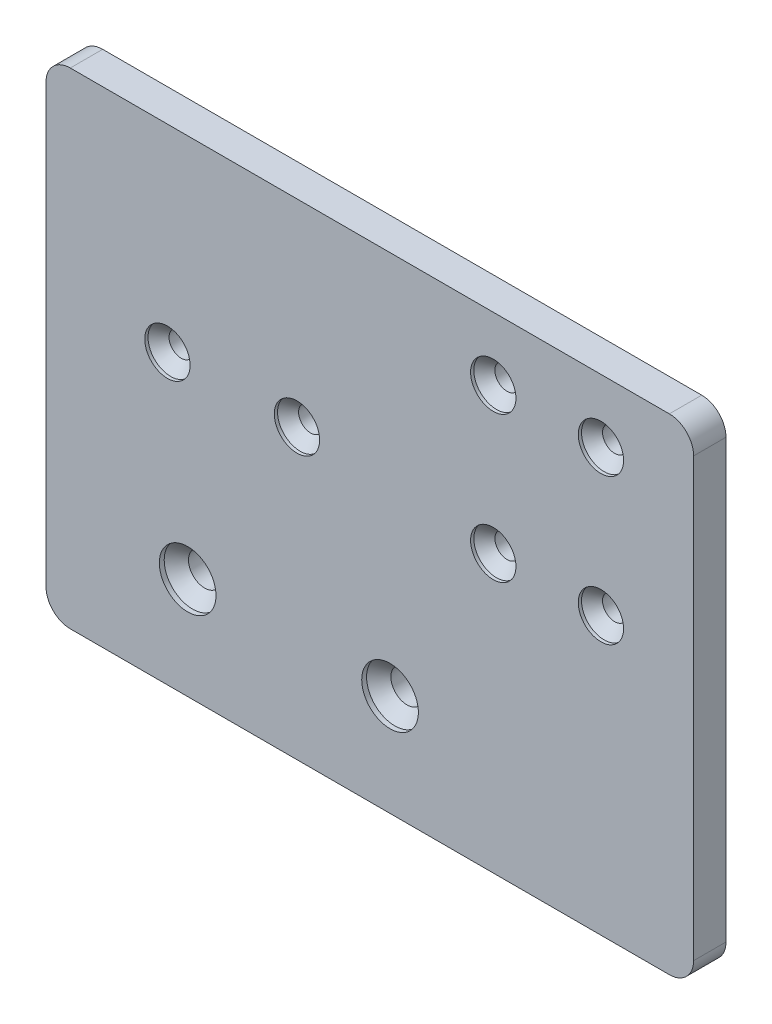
ISO-10303-21;
HEADER;
FILE_DESCRIPTION(('STEP AP214'),'2;1');
FILE_NAME('part.step','',(''),(''),'','','');
FILE_SCHEMA(('AUTOMOTIVE_DESIGN { 1 0 10303 214 1 1 1 1 }'));
ENDSEC;
DATA;
#1=APPLICATION_CONTEXT('core data for automotive mechanical design processes');
#2=APPLICATION_PROTOCOL_DEFINITION('international standard','automotive_design',2000,#1);
#3=PRODUCT_CONTEXT('',#1,'mechanical');
#4=PRODUCT('Part','Part','',(#3));
#5=PRODUCT_RELATED_PRODUCT_CATEGORY('part','',(#4));
#6=PRODUCT_DEFINITION_FORMATION('','',#4);
#7=PRODUCT_DEFINITION_CONTEXT('part definition',#1,'design');
#8=PRODUCT_DEFINITION('design','',#6,#7);
#9=PRODUCT_DEFINITION_SHAPE('','',#8);
#10=(LENGTH_UNIT() NAMED_UNIT(*) SI_UNIT(.MILLI.,.METRE.));
#11=(NAMED_UNIT(*) PLANE_ANGLE_UNIT() SI_UNIT($,.RADIAN.));
#12=(NAMED_UNIT(*) SI_UNIT($,.STERADIAN.) SOLID_ANGLE_UNIT());
#13=UNCERTAINTY_MEASURE_WITH_UNIT(LENGTH_MEASURE(1.E-05),#10,'distance_accuracy_value','');
#14=(GEOMETRIC_REPRESENTATION_CONTEXT(3) GLOBAL_UNCERTAINTY_ASSIGNED_CONTEXT((#13)) GLOBAL_UNIT_ASSIGNED_CONTEXT((#10,
#11,#12)) REPRESENTATION_CONTEXT('',''));
#15=CARTESIAN_POINT('',(0.,0.,0.));
#16=DIRECTION('',(0.,0.,1.));
#17=DIRECTION('',(1.,0.,0.));
#18=AXIS2_PLACEMENT_3D('',#15,#16,#17);
#19=CARTESIAN_POINT('',(0.,0.,4.));
#20=DIRECTION('',(0.,0.,-1.));
#21=DIRECTION('',(-1.,0.,0.));
#22=AXIS2_PLACEMENT_3D('',#19,#20,#21);
#23=PLANE('',#22);
#24=CARTESIAN_POINT('',(19.5,10.16,4.));
#25=DIRECTION('',(0.,0.,-1.));
#26=DIRECTION('',(-1.,0.,0.));
#27=AXIS2_PLACEMENT_3D('',#24,#25,#26);
#28=CIRCLE('',#27,3.5);
#29=CARTESIAN_POINT('',(16.,10.16,4.));
#30=VERTEX_POINT('',#29);
#31=EDGE_CURVE('E198',#30,#30,#28,.T.);
#32=ORIENTED_EDGE('',*,*,#31,.T.);
#33=EDGE_LOOP('',(#32));
#34=FACE_BOUND('',#33,.T.);
#35=CARTESIAN_POINT('',(8.,33.196,4.));
#36=DIRECTION('',(0.,0.,-1.));
#37=DIRECTION('',(-1.,0.,0.));
#38=AXIS2_PLACEMENT_3D('',#35,#36,#37);
#39=CIRCLE('',#38,2.8);
#40=CARTESIAN_POINT('',(5.2,33.196,4.));
#41=VERTEX_POINT('',#40);
#42=EDGE_CURVE('E213',#41,#41,#39,.T.);
#43=ORIENTED_EDGE('',*,*,#42,.T.);
#44=EDGE_LOOP('',(#43));
#45=FACE_BOUND('',#44,.T.);
#46=CARTESIAN_POINT('',(45.55,31.7881872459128,4.));
#47=DIRECTION('',(0.,0.,-1.));
#48=DIRECTION('',(-1.,0.,0.));
#49=AXIS2_PLACEMENT_3D('',#46,#47,#48);
#50=CIRCLE('',#49,2.8);
#51=CARTESIAN_POINT('',(42.75,31.7881872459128,4.));
#52=VERTEX_POINT('',#51);
#53=EDGE_CURVE('E225',#52,#52,#50,.T.);
#54=ORIENTED_EDGE('',*,*,#53,.T.);
#55=EDGE_LOOP('',(#54));
#56=FACE_BOUND('',#55,.T.);
#57=CARTESIAN_POINT('',(45.55,49.7881872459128,4.));
#58=DIRECTION('',(0.,0.,-1.));
#59=DIRECTION('',(-1.,0.,0.));
#60=AXIS2_PLACEMENT_3D('',#57,#58,#59);
#61=CIRCLE('',#60,2.8);
#62=CARTESIAN_POINT('',(42.75,49.7881872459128,4.));
#63=VERTEX_POINT('',#62);
#64=EDGE_CURVE('E237',#63,#63,#61,.T.);
#65=ORIENTED_EDGE('',*,*,#64,.T.);
#66=EDGE_LOOP('',(#65));
#67=FACE_BOUND('',#66,.T.);
#68=DIRECTION('',(-1.,0.,0.));
#69=VECTOR('',#68,1.);
#70=CARTESIAN_POINT('',(-23.,57.6,4.));
#71=LINE('',#70,#69);
#72=CARTESIAN_POINT('',(54.,57.6,4.));
#73=VERTEX_POINT('',#72);
#74=CARTESIAN_POINT('',(-20.,57.6,4.));
#75=VERTEX_POINT('',#74);
#76=EDGE_CURVE('E137',#73,#75,#71,.T.);
#77=ORIENTED_EDGE('',*,*,#76,.T.);
#78=CARTESIAN_POINT('',(-20.,54.6,4.));
#79=DIRECTION('',(0.,0.,-1.));
#80=DIRECTION('',(-1.,0.,0.));
#81=AXIS2_PLACEMENT_3D('',#78,#79,#80);
#82=CIRCLE('',#81,3.);
#83=CARTESIAN_POINT('',(-23.,54.6,4.));
#84=VERTEX_POINT('',#83);
#85=EDGE_CURVE('E156',#75,#84,#82,.F.);
#86=ORIENTED_EDGE('',*,*,#85,.T.);
#87=DIRECTION('',(0.,-1.,0.));
#88=VECTOR('',#87,1.);
#89=CARTESIAN_POINT('',(-23.,-2.40000000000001,4.));
#90=LINE('',#89,#88);
#91=CARTESIAN_POINT('',(-23.,0.599999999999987,4.));
#92=VERTEX_POINT('',#91);
#93=EDGE_CURVE('E120',#84,#92,#90,.T.);
#94=ORIENTED_EDGE('',*,*,#93,.T.);
#95=CARTESIAN_POINT('',(-20.,0.599999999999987,4.));
#96=DIRECTION('',(0.,0.,-1.));
#97=DIRECTION('',(-1.,0.,0.));
#98=AXIS2_PLACEMENT_3D('',#95,#96,#97);
#99=CIRCLE('',#98,3.);
#100=CARTESIAN_POINT('',(-20.,-2.40000000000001,4.));
#101=VERTEX_POINT('',#100);
#102=EDGE_CURVE('E154',#92,#101,#99,.F.);
#103=ORIENTED_EDGE('',*,*,#102,.T.);
#104=DIRECTION('',(1.,0.,0.));
#105=VECTOR('',#104,1.);
#106=CARTESIAN_POINT('',(-23.,-2.40000000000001,4.));
#107=LINE('',#106,#105);
#108=CARTESIAN_POINT('',(54.,-2.40000000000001,4.));
#109=VERTEX_POINT('',#108);
#110=EDGE_CURVE('E266',#101,#109,#107,.T.);
#111=ORIENTED_EDGE('',*,*,#110,.T.);
#112=CARTESIAN_POINT('',(54.,0.599999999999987,4.));
#113=DIRECTION('',(0.,0.,-1.));
#114=DIRECTION('',(-1.,0.,0.));
#115=AXIS2_PLACEMENT_3D('',#112,#113,#114);
#116=CIRCLE('',#115,3.);
#117=CARTESIAN_POINT('',(57.,0.599999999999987,4.));
#118=VERTEX_POINT('',#117);
#119=EDGE_CURVE('E55',#109,#118,#116,.F.);
#120=ORIENTED_EDGE('',*,*,#119,.T.);
#121=DIRECTION('',(0.,1.,0.));
#122=VECTOR('',#121,1.);
#123=CARTESIAN_POINT('',(57.,-2.40000000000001,4.));
#124=LINE('',#123,#122);
#125=CARTESIAN_POINT('',(57.,54.6,4.));
#126=VERTEX_POINT('',#125);
#127=EDGE_CURVE('E267',#118,#126,#124,.T.);
#128=ORIENTED_EDGE('',*,*,#127,.T.);
#129=CARTESIAN_POINT('',(54.,54.6,4.));
#130=DIRECTION('',(0.,0.,-1.));
#131=DIRECTION('',(-1.,0.,0.));
#132=AXIS2_PLACEMENT_3D('',#129,#130,#131);
#133=CIRCLE('',#132,3.);
#134=EDGE_CURVE('E152',#126,#73,#133,.F.);
#135=ORIENTED_EDGE('',*,*,#134,.T.);
#136=EDGE_LOOP('',(#77,#86,#94,#103,#111,#120,#128,#135));
#137=FACE_BOUND('',#136,.T.);
#138=CARTESIAN_POINT('',(32.25,49.7881872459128,4.));
#139=DIRECTION('',(0.,0.,-1.));
#140=DIRECTION('',(-1.,0.,0.));
#141=AXIS2_PLACEMENT_3D('',#138,#139,#140);
#142=CIRCLE('',#141,2.8);
#143=CARTESIAN_POINT('',(29.45,49.7881872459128,4.));
#144=VERTEX_POINT('',#143);
#145=EDGE_CURVE('E231',#144,#144,#142,.T.);
#146=ORIENTED_EDGE('',*,*,#145,.T.);
#147=EDGE_LOOP('',(#146));
#148=FACE_BOUND('',#147,.T.);
#149=CARTESIAN_POINT('',(32.25,31.7881872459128,4.));
#150=DIRECTION('',(0.,0.,-1.));
#151=DIRECTION('',(-1.,0.,0.));
#152=AXIS2_PLACEMENT_3D('',#149,#150,#151);
#153=CIRCLE('',#152,2.8);
#154=CARTESIAN_POINT('',(29.45,31.7881872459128,4.));
#155=VERTEX_POINT('',#154);
#156=EDGE_CURVE('E219',#155,#155,#153,.T.);
#157=ORIENTED_EDGE('',*,*,#156,.T.);
#158=EDGE_LOOP('',(#157));
#159=FACE_BOUND('',#158,.T.);
#160=CARTESIAN_POINT('',(-8.,33.196,4.));
#161=DIRECTION('',(0.,0.,-1.));
#162=DIRECTION('',(-1.,0.,0.));
#163=AXIS2_PLACEMENT_3D('',#160,#161,#162);
#164=CIRCLE('',#163,2.8);
#165=CARTESIAN_POINT('',(-10.8,33.196,4.));
#166=VERTEX_POINT('',#165);
#167=EDGE_CURVE('E208',#166,#166,#164,.T.);
#168=ORIENTED_EDGE('',*,*,#167,.T.);
#169=EDGE_LOOP('',(#168));
#170=FACE_BOUND('',#169,.T.);
#171=CARTESIAN_POINT('',(-5.5,10.16,4.));
#172=DIRECTION('',(0.,0.,-1.));
#173=DIRECTION('',(-1.,0.,0.));
#174=AXIS2_PLACEMENT_3D('',#171,#172,#173);
#175=CIRCLE('',#174,3.5);
#176=CARTESIAN_POINT('',(-9.,10.16,4.));
#177=VERTEX_POINT('',#176);
#178=EDGE_CURVE('E199',#177,#177,#175,.T.);
#179=ORIENTED_EDGE('',*,*,#178,.T.);
#180=EDGE_LOOP('',(#179));
#181=FACE_BOUND('',#180,.T.);
#182=ADVANCED_FACE('F33',(#34,#45,#56,#67,#137,#148,#159,#170,#181),#23,.F.);
#183=CARTESIAN_POINT('',(0.,0.,0.));
#184=DIRECTION('',(0.,0.,-1.));
#185=DIRECTION('',(-1.,0.,0.));
#186=AXIS2_PLACEMENT_3D('',#183,#184,#185);
#187=PLANE('',#186);
#188=CARTESIAN_POINT('',(-5.5,10.16,0.));
#189=DIRECTION('',(0.,0.,1.));
#190=DIRECTION('',(1.,0.,0.));
#191=AXIS2_PLACEMENT_3D('',#188,#189,#190);
#192=CIRCLE('',#191,2.);
#193=CARTESIAN_POINT('',(-3.49999999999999,10.16,0.));
#194=VERTEX_POINT('',#193);
#195=EDGE_CURVE('E248',#194,#194,#192,.T.);
#196=ORIENTED_EDGE('',*,*,#195,.T.);
#197=EDGE_LOOP('',(#196));
#198=FACE_BOUND('',#197,.T.);
#199=CARTESIAN_POINT('',(32.25,31.7881872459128,0.));
#200=DIRECTION('',(0.,0.,1.));
#201=DIRECTION('',(1.,0.,0.));
#202=AXIS2_PLACEMENT_3D('',#199,#200,#201);
#203=CIRCLE('',#202,1.5);
#204=CARTESIAN_POINT('',(33.75,31.7881872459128,0.));
#205=VERTEX_POINT('',#204);
#206=EDGE_CURVE('E254',#205,#205,#203,.T.);
#207=ORIENTED_EDGE('',*,*,#206,.T.);
#208=EDGE_LOOP('',(#207));
#209=FACE_BOUND('',#208,.T.);
#210=CARTESIAN_POINT('',(32.25,49.7881872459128,0.));
#211=DIRECTION('',(0.,0.,1.));
#212=DIRECTION('',(1.,0.,0.));
#213=AXIS2_PLACEMENT_3D('',#210,#211,#212);
#214=CIRCLE('',#213,1.5);
#215=CARTESIAN_POINT('',(33.75,49.7881872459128,0.));
#216=VERTEX_POINT('',#215);
#217=EDGE_CURVE('E260',#216,#216,#214,.T.);
#218=ORIENTED_EDGE('',*,*,#217,.T.);
#219=EDGE_LOOP('',(#218));
#220=FACE_BOUND('',#219,.T.);
#221=CARTESIAN_POINT('',(-8.,33.196,0.));
#222=DIRECTION('',(0.,0.,1.));
#223=DIRECTION('',(1.,0.,0.));
#224=AXIS2_PLACEMENT_3D('',#221,#222,#223);
#225=CIRCLE('',#224,1.5);
#226=CARTESIAN_POINT('',(-6.5,33.196,0.));
#227=VERTEX_POINT('',#226);
#228=EDGE_CURVE('E128',#227,#227,#225,.T.);
#229=ORIENTED_EDGE('',*,*,#228,.T.);
#230=EDGE_LOOP('',(#229));
#231=FACE_BOUND('',#230,.T.);
#232=DIRECTION('',(0.,-1.,0.));
#233=VECTOR('',#232,1.);
#234=CARTESIAN_POINT('',(-23.,-2.40000000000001,0.));
#235=LINE('',#234,#233);
#236=CARTESIAN_POINT('',(-23.,54.6,0.));
#237=VERTEX_POINT('',#236);
#238=CARTESIAN_POINT('',(-23.,0.599999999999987,0.));
#239=VERTEX_POINT('',#238);
#240=EDGE_CURVE('E117',#237,#239,#235,.T.);
#241=ORIENTED_EDGE('',*,*,#240,.F.);
#242=CARTESIAN_POINT('',(-20.,54.6,0.));
#243=DIRECTION('',(0.,0.,-1.));
#244=DIRECTION('',(-1.,0.,0.));
#245=AXIS2_PLACEMENT_3D('',#242,#243,#244);
#246=CIRCLE('',#245,3.);
#247=CARTESIAN_POINT('',(-20.,57.6,0.));
#248=VERTEX_POINT('',#247);
#249=EDGE_CURVE('E100',#237,#248,#246,.T.);
#250=ORIENTED_EDGE('',*,*,#249,.T.);
#251=DIRECTION('',(-1.,0.,0.));
#252=VECTOR('',#251,1.);
#253=CARTESIAN_POINT('',(-23.,57.6,0.));
#254=LINE('',#253,#252);
#255=CARTESIAN_POINT('',(54.,57.6,0.));
#256=VERTEX_POINT('',#255);
#257=EDGE_CURVE('E141',#256,#248,#254,.T.);
#258=ORIENTED_EDGE('',*,*,#257,.F.);
#259=CARTESIAN_POINT('',(54.,54.6,0.));
#260=DIRECTION('',(0.,0.,-1.));
#261=DIRECTION('',(-1.,0.,0.));
#262=AXIS2_PLACEMENT_3D('',#259,#260,#261);
#263=CIRCLE('',#262,3.);
#264=CARTESIAN_POINT('',(57.,54.6,0.));
#265=VERTEX_POINT('',#264);
#266=EDGE_CURVE('E145',#256,#265,#263,.T.);
#267=ORIENTED_EDGE('',*,*,#266,.T.);
#268=DIRECTION('',(0.,1.,0.));
#269=VECTOR('',#268,1.);
#270=CARTESIAN_POINT('',(57.,-2.40000000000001,0.));
#271=LINE('',#270,#269);
#272=CARTESIAN_POINT('',(57.,0.599999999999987,0.));
#273=VERTEX_POINT('',#272);
#274=EDGE_CURVE('E131',#273,#265,#271,.T.);
#275=ORIENTED_EDGE('',*,*,#274,.F.);
#276=CARTESIAN_POINT('',(54.,0.599999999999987,0.));
#277=DIRECTION('',(0.,0.,-1.));
#278=DIRECTION('',(-1.,0.,0.));
#279=AXIS2_PLACEMENT_3D('',#276,#277,#278);
#280=CIRCLE('',#279,3.);
#281=CARTESIAN_POINT('',(54.,-2.40000000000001,0.));
#282=VERTEX_POINT('',#281);
#283=EDGE_CURVE('E121',#273,#282,#280,.T.);
#284=ORIENTED_EDGE('',*,*,#283,.T.);
#285=DIRECTION('',(1.,0.,0.));
#286=VECTOR('',#285,1.);
#287=CARTESIAN_POINT('',(-23.,-2.40000000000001,0.));
#288=LINE('',#287,#286);
#289=CARTESIAN_POINT('',(-20.,-2.40000000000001,0.));
#290=VERTEX_POINT('',#289);
#291=EDGE_CURVE('E127',#290,#282,#288,.T.);
#292=ORIENTED_EDGE('',*,*,#291,.F.);
#293=CARTESIAN_POINT('',(-20.,0.599999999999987,0.));
#294=DIRECTION('',(0.,0.,-1.));
#295=DIRECTION('',(-1.,0.,0.));
#296=AXIS2_PLACEMENT_3D('',#293,#294,#295);
#297=CIRCLE('',#296,3.);
#298=EDGE_CURVE('E111',#290,#239,#297,.T.);
#299=ORIENTED_EDGE('',*,*,#298,.T.);
#300=EDGE_LOOP('',(#241,#250,#258,#267,#275,#284,#292,#299));
#301=FACE_BOUND('',#300,.T.);
#302=CARTESIAN_POINT('',(8.,33.196,0.));
#303=DIRECTION('',(0.,0.,1.));
#304=DIRECTION('',(1.,0.,0.));
#305=AXIS2_PLACEMENT_3D('',#302,#303,#304);
#306=CIRCLE('',#305,1.5);
#307=CARTESIAN_POINT('',(9.5,33.196,0.));
#308=VERTEX_POINT('',#307);
#309=EDGE_CURVE('E134',#308,#308,#306,.T.);
#310=ORIENTED_EDGE('',*,*,#309,.T.);
#311=EDGE_LOOP('',(#310));
#312=FACE_BOUND('',#311,.T.);
#313=CARTESIAN_POINT('',(45.55,49.7881872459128,0.));
#314=DIRECTION('',(0.,0.,1.));
#315=DIRECTION('',(1.,0.,0.));
#316=AXIS2_PLACEMENT_3D('',#313,#314,#315);
#317=CIRCLE('',#316,1.5);
#318=CARTESIAN_POINT('',(47.05,49.7881872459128,0.));
#319=VERTEX_POINT('',#318);
#320=EDGE_CURVE('E257',#319,#319,#317,.T.);
#321=ORIENTED_EDGE('',*,*,#320,.T.);
#322=EDGE_LOOP('',(#321));
#323=FACE_BOUND('',#322,.T.);
#324=CARTESIAN_POINT('',(45.55,31.7881872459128,0.));
#325=DIRECTION('',(0.,0.,1.));
#326=DIRECTION('',(1.,0.,0.));
#327=AXIS2_PLACEMENT_3D('',#324,#325,#326);
#328=CIRCLE('',#327,1.5);
#329=CARTESIAN_POINT('',(47.05,31.7881872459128,0.));
#330=VERTEX_POINT('',#329);
#331=EDGE_CURVE('E251',#330,#330,#328,.T.);
#332=ORIENTED_EDGE('',*,*,#331,.T.);
#333=EDGE_LOOP('',(#332));
#334=FACE_BOUND('',#333,.T.);
#335=CARTESIAN_POINT('',(19.5,10.16,0.));
#336=DIRECTION('',(0.,0.,1.));
#337=DIRECTION('',(1.,0.,0.));
#338=AXIS2_PLACEMENT_3D('',#335,#336,#337);
#339=CIRCLE('',#338,2.00000000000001);
#340=CARTESIAN_POINT('',(21.5,10.16,0.));
#341=VERTEX_POINT('',#340);
#342=EDGE_CURVE('E243',#341,#341,#339,.T.);
#343=ORIENTED_EDGE('',*,*,#342,.T.);
#344=EDGE_LOOP('',(#343));
#345=FACE_BOUND('',#344,.T.);
#346=ADVANCED_FACE('F124',(#198,#209,#220,#231,#301,#312,#323,#334,#345),#187,.T.);
#347=CARTESIAN_POINT('',(-23.,-2.40000000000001,4.));
#348=DIRECTION('',(1.,0.,0.));
#349=DIRECTION('',(0.,0.,-1.));
#350=AXIS2_PLACEMENT_3D('',#347,#348,#349);
#351=PLANE('',#350);
#352=ORIENTED_EDGE('',*,*,#93,.F.);
#353=DIRECTION('',(0.,0.,-1.));
#354=VECTOR('',#353,1.);
#355=CARTESIAN_POINT('',(-23.,54.6,4.));
#356=LINE('',#355,#354);
#357=EDGE_CURVE('E104',#84,#237,#356,.T.);
#358=ORIENTED_EDGE('',*,*,#357,.T.);
#359=ORIENTED_EDGE('',*,*,#240,.T.);
#360=DIRECTION('',(0.,0.,-1.));
#361=VECTOR('',#360,1.);
#362=CARTESIAN_POINT('',(-23.,0.599999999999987,4.));
#363=LINE('',#362,#361);
#364=EDGE_CURVE('E122',#239,#92,#363,.F.);
#365=ORIENTED_EDGE('',*,*,#364,.T.);
#366=EDGE_LOOP('',(#352,#358,#359,#365));
#367=FACE_BOUND('',#366,.T.);
#368=ADVANCED_FACE('F116',(#367),#351,.F.);
#369=CARTESIAN_POINT('',(-23.,-2.40000000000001,4.));
#370=DIRECTION('',(0.,1.,0.));
#371=DIRECTION('',(0.,0.,1.));
#372=AXIS2_PLACEMENT_3D('',#369,#370,#371);
#373=PLANE('',#372);
#374=ORIENTED_EDGE('',*,*,#110,.F.);
#375=DIRECTION('',(0.,0.,-1.));
#376=VECTOR('',#375,1.);
#377=CARTESIAN_POINT('',(-20.,-2.40000000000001,4.));
#378=LINE('',#377,#376);
#379=EDGE_CURVE('E160',#101,#290,#378,.T.);
#380=ORIENTED_EDGE('',*,*,#379,.T.);
#381=ORIENTED_EDGE('',*,*,#291,.T.);
#382=DIRECTION('',(0.,0.,-1.));
#383=VECTOR('',#382,1.);
#384=CARTESIAN_POINT('',(54.,-2.40000000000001,4.));
#385=LINE('',#384,#383);
#386=EDGE_CURVE('E158',#282,#109,#385,.F.);
#387=ORIENTED_EDGE('',*,*,#386,.T.);
#388=EDGE_LOOP('',(#374,#380,#381,#387));
#389=FACE_BOUND('',#388,.T.);
#390=ADVANCED_FACE('F285',(#389),#373,.F.);
#391=CARTESIAN_POINT('',(57.,-2.40000000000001,4.));
#392=DIRECTION('',(-1.,0.,0.));
#393=DIRECTION('',(0.,0.,1.));
#394=AXIS2_PLACEMENT_3D('',#391,#392,#393);
#395=PLANE('',#394);
#396=ORIENTED_EDGE('',*,*,#274,.T.);
#397=DIRECTION('',(0.,0.,-1.));
#398=VECTOR('',#397,1.);
#399=CARTESIAN_POINT('',(57.,54.6,4.));
#400=LINE('',#399,#398);
#401=EDGE_CURVE('E48',#265,#126,#400,.F.);
#402=ORIENTED_EDGE('',*,*,#401,.T.);
#403=ORIENTED_EDGE('',*,*,#127,.F.);
#404=DIRECTION('',(0.,0.,-1.));
#405=VECTOR('',#404,1.);
#406=CARTESIAN_POINT('',(57.,0.599999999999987,4.));
#407=LINE('',#406,#405);
#408=EDGE_CURVE('E163',#118,#273,#407,.T.);
#409=ORIENTED_EDGE('',*,*,#408,.T.);
#410=EDGE_LOOP('',(#396,#402,#403,#409));
#411=FACE_BOUND('',#410,.T.);
#412=ADVANCED_FACE('F278',(#411),#395,.F.);
#413=CARTESIAN_POINT('',(-23.,57.6,4.));
#414=DIRECTION('',(0.,-1.,0.));
#415=DIRECTION('',(0.,0.,-1.));
#416=AXIS2_PLACEMENT_3D('',#413,#414,#415);
#417=PLANE('',#416);
#418=ORIENTED_EDGE('',*,*,#257,.T.);
#419=DIRECTION('',(0.,0.,-1.));
#420=VECTOR('',#419,1.);
#421=CARTESIAN_POINT('',(-20.,57.6,4.));
#422=LINE('',#421,#420);
#423=EDGE_CURVE('E105',#248,#75,#422,.F.);
#424=ORIENTED_EDGE('',*,*,#423,.T.);
#425=ORIENTED_EDGE('',*,*,#76,.F.);
#426=DIRECTION('',(0.,0.,-1.));
#427=VECTOR('',#426,1.);
#428=CARTESIAN_POINT('',(54.,57.6,4.));
#429=LINE('',#428,#427);
#430=EDGE_CURVE('E110',#73,#256,#429,.T.);
#431=ORIENTED_EDGE('',*,*,#430,.T.);
#432=EDGE_LOOP('',(#418,#424,#425,#431));
#433=FACE_BOUND('',#432,.T.);
#434=ADVANCED_FACE('F274',(#433),#417,.F.);
#435=CARTESIAN_POINT('',(-8.,33.196,4.));
#436=DIRECTION('',(0.,0.,-1.));
#437=DIRECTION('',(-1.,0.,0.));
#438=AXIS2_PLACEMENT_3D('',#435,#436,#437);
#439=CYLINDRICAL_SURFACE('',#438,1.5);
#440=CARTESIAN_POINT('',(-8.,33.196,2.29999999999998));
#441=DIRECTION('',(0.,0.,-1.));
#442=DIRECTION('',(-1.,0.,0.));
#443=AXIS2_PLACEMENT_3D('',#440,#441,#442);
#444=CIRCLE('',#443,1.5);
#445=CARTESIAN_POINT('',(-6.5,33.196,2.29999999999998));
#446=VERTEX_POINT('',#445);
#447=EDGE_CURVE('E167',#446,#446,#444,.F.);
#448=ORIENTED_EDGE('',*,*,#447,.T.);
#449=EDGE_LOOP('',(#448));
#450=FACE_BOUND('',#449,.T.);
#451=ORIENTED_EDGE('',*,*,#228,.F.);
#452=EDGE_LOOP('',(#451));
#453=FACE_BOUND('',#452,.T.);
#454=ADVANCED_FACE('F311',(#450,#453),#439,.F.);
#455=CARTESIAN_POINT('',(8.,33.196,4.));
#456=DIRECTION('',(0.,0.,-1.));
#457=DIRECTION('',(-1.,0.,0.));
#458=AXIS2_PLACEMENT_3D('',#455,#456,#457);
#459=CYLINDRICAL_SURFACE('',#458,1.5);
#460=CARTESIAN_POINT('',(8.,33.196,2.29999999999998));
#461=DIRECTION('',(0.,0.,-1.));
#462=DIRECTION('',(-1.,0.,0.));
#463=AXIS2_PLACEMENT_3D('',#460,#461,#462);
#464=CIRCLE('',#463,1.5);
#465=CARTESIAN_POINT('',(9.5,33.196,2.29999999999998));
#466=VERTEX_POINT('',#465);
#467=EDGE_CURVE('E170',#466,#466,#464,.F.);
#468=ORIENTED_EDGE('',*,*,#467,.T.);
#469=EDGE_LOOP('',(#468));
#470=FACE_BOUND('',#469,.T.);
#471=ORIENTED_EDGE('',*,*,#309,.F.);
#472=EDGE_LOOP('',(#471));
#473=FACE_BOUND('',#472,.T.);
#474=ADVANCED_FACE('F345',(#470,#473),#459,.F.);
#475=CARTESIAN_POINT('',(32.25,49.7881872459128,4.));
#476=DIRECTION('',(0.,0.,-1.));
#477=DIRECTION('',(-1.,0.,0.));
#478=AXIS2_PLACEMENT_3D('',#475,#476,#477);
#479=CYLINDRICAL_SURFACE('',#478,1.5);
#480=CARTESIAN_POINT('',(32.25,49.7881872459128,2.29999999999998));
#481=DIRECTION('',(0.,0.,-1.));
#482=DIRECTION('',(-1.,0.,0.));
#483=AXIS2_PLACEMENT_3D('',#480,#481,#482);
#484=CIRCLE('',#483,1.5);
#485=CARTESIAN_POINT('',(33.75,49.7881872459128,2.29999999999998));
#486=VERTEX_POINT('',#485);
#487=EDGE_CURVE('E176',#486,#486,#484,.F.);
#488=ORIENTED_EDGE('',*,*,#487,.T.);
#489=EDGE_LOOP('',(#488));
#490=FACE_BOUND('',#489,.T.);
#491=ORIENTED_EDGE('',*,*,#217,.F.);
#492=EDGE_LOOP('',(#491));
#493=FACE_BOUND('',#492,.T.);
#494=ADVANCED_FACE('F355',(#490,#493),#479,.F.);
#495=CARTESIAN_POINT('',(45.55,49.7881872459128,4.));
#496=DIRECTION('',(0.,0.,-1.));
#497=DIRECTION('',(-1.,0.,0.));
#498=AXIS2_PLACEMENT_3D('',#495,#496,#497);
#499=CYLINDRICAL_SURFACE('',#498,1.5);
#500=CARTESIAN_POINT('',(45.55,49.7881872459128,2.29999999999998));
#501=DIRECTION('',(0.,0.,-1.));
#502=DIRECTION('',(-1.,0.,0.));
#503=AXIS2_PLACEMENT_3D('',#500,#501,#502);
#504=CIRCLE('',#503,1.5);
#505=CARTESIAN_POINT('',(47.05,49.7881872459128,2.29999999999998));
#506=VERTEX_POINT('',#505);
#507=EDGE_CURVE('E182',#506,#506,#504,.F.);
#508=ORIENTED_EDGE('',*,*,#507,.T.);
#509=EDGE_LOOP('',(#508));
#510=FACE_BOUND('',#509,.T.);
#511=ORIENTED_EDGE('',*,*,#320,.F.);
#512=EDGE_LOOP('',(#511));
#513=FACE_BOUND('',#512,.T.);
#514=ADVANCED_FACE('F364',(#510,#513),#499,.F.);
#515=CARTESIAN_POINT('',(32.25,31.7881872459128,4.));
#516=DIRECTION('',(0.,0.,-1.));
#517=DIRECTION('',(-1.,0.,0.));
#518=AXIS2_PLACEMENT_3D('',#515,#516,#517);
#519=CYLINDRICAL_SURFACE('',#518,1.5);
#520=CARTESIAN_POINT('',(32.25,31.7881872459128,2.29999999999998));
#521=DIRECTION('',(0.,0.,-1.));
#522=DIRECTION('',(-1.,0.,0.));
#523=AXIS2_PLACEMENT_3D('',#520,#521,#522);
#524=CIRCLE('',#523,1.5);
#525=CARTESIAN_POINT('',(33.75,31.7881872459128,2.29999999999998));
#526=VERTEX_POINT('',#525);
#527=EDGE_CURVE('E173',#526,#526,#524,.F.);
#528=ORIENTED_EDGE('',*,*,#527,.T.);
#529=EDGE_LOOP('',(#528));
#530=FACE_BOUND('',#529,.T.);
#531=ORIENTED_EDGE('',*,*,#206,.F.);
#532=EDGE_LOOP('',(#531));
#533=FACE_BOUND('',#532,.T.);
#534=ADVANCED_FACE('F374',(#530,#533),#519,.F.);
#535=CARTESIAN_POINT('',(45.55,31.7881872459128,4.));
#536=DIRECTION('',(0.,0.,-1.));
#537=DIRECTION('',(-1.,0.,0.));
#538=AXIS2_PLACEMENT_3D('',#535,#536,#537);
#539=CYLINDRICAL_SURFACE('',#538,1.5);
#540=CARTESIAN_POINT('',(45.55,31.7881872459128,2.29999999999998));
#541=DIRECTION('',(0.,0.,-1.));
#542=DIRECTION('',(-1.,0.,0.));
#543=AXIS2_PLACEMENT_3D('',#540,#541,#542);
#544=CIRCLE('',#543,1.5);
#545=CARTESIAN_POINT('',(47.05,31.7881872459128,2.29999999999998));
#546=VERTEX_POINT('',#545);
#547=EDGE_CURVE('E179',#546,#546,#544,.F.);
#548=ORIENTED_EDGE('',*,*,#547,.T.);
#549=EDGE_LOOP('',(#548));
#550=FACE_BOUND('',#549,.T.);
#551=ORIENTED_EDGE('',*,*,#331,.F.);
#552=EDGE_LOOP('',(#551));
#553=FACE_BOUND('',#552,.T.);
#554=ADVANCED_FACE('F384',(#550,#553),#539,.F.);
#555=CARTESIAN_POINT('',(-5.5,10.16,4.));
#556=DIRECTION('',(0.,0.,-1.));
#557=DIRECTION('',(-1.,0.,0.));
#558=AXIS2_PLACEMENT_3D('',#555,#556,#557);
#559=CYLINDRICAL_SURFACE('',#558,2.);
#560=CARTESIAN_POINT('',(-5.5,10.16,1.89999999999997));
#561=DIRECTION('',(0.,0.,-1.));
#562=DIRECTION('',(-1.,0.,0.));
#563=AXIS2_PLACEMENT_3D('',#560,#561,#562);
#564=CIRCLE('',#563,2.);
#565=CARTESIAN_POINT('',(-7.5,10.16,1.89999999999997));
#566=VERTEX_POINT('',#565);
#567=EDGE_CURVE('E41',#566,#566,#564,.F.);
#568=ORIENTED_EDGE('',*,*,#567,.T.);
#569=EDGE_LOOP('',(#568));
#570=FACE_BOUND('',#569,.T.);
#571=ORIENTED_EDGE('',*,*,#195,.F.);
#572=EDGE_LOOP('',(#571));
#573=FACE_BOUND('',#572,.T.);
#574=ADVANCED_FACE('F187',(#570,#573),#559,.F.);
#575=CARTESIAN_POINT('',(19.5,10.16,4.));
#576=DIRECTION('',(0.,0.,-1.));
#577=DIRECTION('',(-1.,0.,0.));
#578=AXIS2_PLACEMENT_3D('',#575,#576,#577);
#579=CYLINDRICAL_SURFACE('',#578,2.00000000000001);
#580=CARTESIAN_POINT('',(19.5,10.16,1.89999999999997));
#581=DIRECTION('',(0.,0.,-1.));
#582=DIRECTION('',(-1.,0.,0.));
#583=AXIS2_PLACEMENT_3D('',#580,#581,#582);
#584=CIRCLE('',#583,2.00000000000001);
#585=CARTESIAN_POINT('',(17.5,10.16,1.89999999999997));
#586=VERTEX_POINT('',#585);
#587=EDGE_CURVE('E11',#586,#586,#584,.F.);
#588=ORIENTED_EDGE('',*,*,#587,.T.);
#589=EDGE_LOOP('',(#588));
#590=FACE_BOUND('',#589,.T.);
#591=ORIENTED_EDGE('',*,*,#342,.F.);
#592=EDGE_LOOP('',(#591));
#593=FACE_BOUND('',#592,.T.);
#594=ADVANCED_FACE('F297',(#590,#593),#579,.F.);
#595=CARTESIAN_POINT('',(-20.,54.6,4.));
#596=DIRECTION('',(0.,0.,-1.));
#597=DIRECTION('',(-1.,0.,0.));
#598=AXIS2_PLACEMENT_3D('',#595,#596,#597);
#599=CYLINDRICAL_SURFACE('',#598,3.);
#600=ORIENTED_EDGE('',*,*,#85,.F.);
#601=ORIENTED_EDGE('',*,*,#423,.F.);
#602=ORIENTED_EDGE('',*,*,#249,.F.);
#603=ORIENTED_EDGE('',*,*,#357,.F.);
#604=EDGE_LOOP('',(#600,#601,#602,#603));
#605=FACE_BOUND('',#604,.T.);
#606=ADVANCED_FACE('F103',(#605),#599,.T.);
#607=CARTESIAN_POINT('',(-20.,0.599999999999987,4.));
#608=DIRECTION('',(0.,0.,-1.));
#609=DIRECTION('',(-1.,0.,0.));
#610=AXIS2_PLACEMENT_3D('',#607,#608,#609);
#611=CYLINDRICAL_SURFACE('',#610,3.);
#612=ORIENTED_EDGE('',*,*,#102,.F.);
#613=ORIENTED_EDGE('',*,*,#364,.F.);
#614=ORIENTED_EDGE('',*,*,#298,.F.);
#615=ORIENTED_EDGE('',*,*,#379,.F.);
#616=EDGE_LOOP('',(#612,#613,#614,#615));
#617=FACE_BOUND('',#616,.T.);
#618=ADVANCED_FACE('F289',(#617),#611,.T.);
#619=CARTESIAN_POINT('',(54.,54.6,4.));
#620=DIRECTION('',(0.,0.,-1.));
#621=DIRECTION('',(-1.,0.,0.));
#622=AXIS2_PLACEMENT_3D('',#619,#620,#621);
#623=CYLINDRICAL_SURFACE('',#622,3.);
#624=ORIENTED_EDGE('',*,*,#134,.F.);
#625=ORIENTED_EDGE('',*,*,#401,.F.);
#626=ORIENTED_EDGE('',*,*,#266,.F.);
#627=ORIENTED_EDGE('',*,*,#430,.F.);
#628=EDGE_LOOP('',(#624,#625,#626,#627));
#629=FACE_BOUND('',#628,.T.);
#630=ADVANCED_FACE('F276',(#629),#623,.T.);
#631=CARTESIAN_POINT('',(54.,0.599999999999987,4.));
#632=DIRECTION('',(0.,0.,-1.));
#633=DIRECTION('',(-1.,0.,0.));
#634=AXIS2_PLACEMENT_3D('',#631,#632,#633);
#635=CYLINDRICAL_SURFACE('',#634,3.);
#636=ORIENTED_EDGE('',*,*,#119,.F.);
#637=ORIENTED_EDGE('',*,*,#386,.F.);
#638=ORIENTED_EDGE('',*,*,#283,.F.);
#639=ORIENTED_EDGE('',*,*,#408,.F.);
#640=EDGE_LOOP('',(#636,#637,#638,#639));
#641=FACE_BOUND('',#640,.T.);
#642=ADVANCED_FACE('F281',(#641),#635,.T.);
#643=CARTESIAN_POINT('',(45.55,49.7881872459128,3.6));
#644=DIRECTION('',(0.,0.,1.));
#645=DIRECTION('',(1.,0.,0.));
#646=AXIS2_PLACEMENT_3D('',#643,#644,#645);
#647=CYLINDRICAL_SURFACE('',#646,2.8);
#648=CARTESIAN_POINT('',(45.55,49.7881872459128,3.6));
#649=DIRECTION('',(0.,0.,-1.));
#650=DIRECTION('',(-1.,0.,0.));
#651=AXIS2_PLACEMENT_3D('',#648,#649,#650);
#652=CIRCLE('',#651,2.8);
#653=CARTESIAN_POINT('',(48.35,49.7881872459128,3.6));
#654=VERTEX_POINT('',#653);
#655=EDGE_CURVE('E240',#654,#654,#652,.T.);
#656=ORIENTED_EDGE('',*,*,#655,.T.);
#657=EDGE_LOOP('',(#656));
#658=FACE_BOUND('',#657,.T.);
#659=ORIENTED_EDGE('',*,*,#64,.F.);
#660=EDGE_LOOP('',(#659));
#661=FACE_BOUND('',#660,.T.);
#662=ADVANCED_FACE('F438',(#658,#661),#647,.F.);
#663=CARTESIAN_POINT('',(32.25,49.7881872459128,3.6));
#664=DIRECTION('',(0.,0.,1.));
#665=DIRECTION('',(1.,0.,0.));
#666=AXIS2_PLACEMENT_3D('',#663,#664,#665);
#667=CYLINDRICAL_SURFACE('',#666,2.8);
#668=CARTESIAN_POINT('',(32.25,49.7881872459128,3.6));
#669=DIRECTION('',(0.,0.,-1.));
#670=DIRECTION('',(-1.,0.,0.));
#671=AXIS2_PLACEMENT_3D('',#668,#669,#670);
#672=CIRCLE('',#671,2.8);
#673=CARTESIAN_POINT('',(35.05,49.7881872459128,3.6));
#674=VERTEX_POINT('',#673);
#675=EDGE_CURVE('E234',#674,#674,#672,.T.);
#676=ORIENTED_EDGE('',*,*,#675,.T.);
#677=EDGE_LOOP('',(#676));
#678=FACE_BOUND('',#677,.T.);
#679=ORIENTED_EDGE('',*,*,#145,.F.);
#680=EDGE_LOOP('',(#679));
#681=FACE_BOUND('',#680,.T.);
#682=ADVANCED_FACE('F447',(#678,#681),#667,.F.);
#683=CARTESIAN_POINT('',(45.55,31.7881872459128,3.6));
#684=DIRECTION('',(0.,0.,1.));
#685=DIRECTION('',(1.,0.,0.));
#686=AXIS2_PLACEMENT_3D('',#683,#684,#685);
#687=CYLINDRICAL_SURFACE('',#686,2.8);
#688=CARTESIAN_POINT('',(45.55,31.7881872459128,3.6));
#689=DIRECTION('',(0.,0.,-1.));
#690=DIRECTION('',(-1.,0.,0.));
#691=AXIS2_PLACEMENT_3D('',#688,#689,#690);
#692=CIRCLE('',#691,2.8);
#693=CARTESIAN_POINT('',(48.35,31.7881872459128,3.6));
#694=VERTEX_POINT('',#693);
#695=EDGE_CURVE('E228',#694,#694,#692,.T.);
#696=ORIENTED_EDGE('',*,*,#695,.T.);
#697=EDGE_LOOP('',(#696));
#698=FACE_BOUND('',#697,.T.);
#699=ORIENTED_EDGE('',*,*,#53,.F.);
#700=EDGE_LOOP('',(#699));
#701=FACE_BOUND('',#700,.T.);
#702=ADVANCED_FACE('F457',(#698,#701),#687,.F.);
#703=CARTESIAN_POINT('',(32.25,31.7881872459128,3.6));
#704=DIRECTION('',(0.,0.,1.));
#705=DIRECTION('',(1.,0.,0.));
#706=AXIS2_PLACEMENT_3D('',#703,#704,#705);
#707=CYLINDRICAL_SURFACE('',#706,2.8);
#708=CARTESIAN_POINT('',(32.25,31.7881872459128,3.6));
#709=DIRECTION('',(0.,0.,-1.));
#710=DIRECTION('',(-1.,0.,0.));
#711=AXIS2_PLACEMENT_3D('',#708,#709,#710);
#712=CIRCLE('',#711,2.8);
#713=CARTESIAN_POINT('',(35.05,31.7881872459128,3.6));
#714=VERTEX_POINT('',#713);
#715=EDGE_CURVE('E222',#714,#714,#712,.T.);
#716=ORIENTED_EDGE('',*,*,#715,.T.);
#717=EDGE_LOOP('',(#716));
#718=FACE_BOUND('',#717,.T.);
#719=ORIENTED_EDGE('',*,*,#156,.F.);
#720=EDGE_LOOP('',(#719));
#721=FACE_BOUND('',#720,.T.);
#722=ADVANCED_FACE('F467',(#718,#721),#707,.F.);
#723=CARTESIAN_POINT('',(8.,33.196,3.6));
#724=DIRECTION('',(0.,0.,1.));
#725=DIRECTION('',(1.,0.,0.));
#726=AXIS2_PLACEMENT_3D('',#723,#724,#725);
#727=CYLINDRICAL_SURFACE('',#726,2.8);
#728=CARTESIAN_POINT('',(8.,33.196,3.6));
#729=DIRECTION('',(0.,0.,-1.));
#730=DIRECTION('',(-1.,0.,0.));
#731=AXIS2_PLACEMENT_3D('',#728,#729,#730);
#732=CIRCLE('',#731,2.8);
#733=CARTESIAN_POINT('',(10.8,33.196,3.6));
#734=VERTEX_POINT('',#733);
#735=EDGE_CURVE('E216',#734,#734,#732,.T.);
#736=ORIENTED_EDGE('',*,*,#735,.T.);
#737=EDGE_LOOP('',(#736));
#738=FACE_BOUND('',#737,.T.);
#739=ORIENTED_EDGE('',*,*,#42,.F.);
#740=EDGE_LOOP('',(#739));
#741=FACE_BOUND('',#740,.T.);
#742=ADVANCED_FACE('F477',(#738,#741),#727,.F.);
#743=CARTESIAN_POINT('',(-8.,33.196,3.6));
#744=DIRECTION('',(0.,0.,1.));
#745=DIRECTION('',(1.,0.,0.));
#746=AXIS2_PLACEMENT_3D('',#743,#744,#745);
#747=CYLINDRICAL_SURFACE('',#746,2.8);
#748=CARTESIAN_POINT('',(-8.,33.196,3.6));
#749=DIRECTION('',(0.,0.,-1.));
#750=DIRECTION('',(-1.,0.,0.));
#751=AXIS2_PLACEMENT_3D('',#748,#749,#750);
#752=CIRCLE('',#751,2.8);
#753=CARTESIAN_POINT('',(-5.19999999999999,33.196,3.6));
#754=VERTEX_POINT('',#753);
#755=EDGE_CURVE('E210',#754,#754,#752,.T.);
#756=ORIENTED_EDGE('',*,*,#755,.T.);
#757=EDGE_LOOP('',(#756));
#758=FACE_BOUND('',#757,.T.);
#759=ORIENTED_EDGE('',*,*,#167,.F.);
#760=EDGE_LOOP('',(#759));
#761=FACE_BOUND('',#760,.T.);
#762=ADVANCED_FACE('F486',(#758,#761),#747,.F.);
#763=CARTESIAN_POINT('',(-8.,33.196,3.6));
#764=DIRECTION('',(0.,0.,1.));
#765=DIRECTION('',(1.,0.,0.));
#766=AXIS2_PLACEMENT_3D('',#763,#764,#765);
#767=CONICAL_SURFACE('',#766,2.80000000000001,0.785398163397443);
#768=CARTESIAN_POINT('',(-6.5,33.196,2.29999999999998));
#769=CARTESIAN_POINT('',(-6.48645833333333,33.196,2.31354166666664));
#770=CARTESIAN_POINT('',(-6.47291666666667,33.196,2.32708333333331));
#771=CARTESIAN_POINT('',(-6.44583333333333,33.196,2.35416666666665));
#772=CARTESIAN_POINT('',(-6.43229166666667,33.196,2.36770833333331));
#773=CARTESIAN_POINT('',(-6.40520833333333,33.196,2.39479166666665));
#774=CARTESIAN_POINT('',(-6.39166666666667,33.196,2.40833333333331));
#775=CARTESIAN_POINT('',(-6.36458333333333,33.196,2.43541666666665));
#776=CARTESIAN_POINT('',(-6.35104166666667,33.196,2.44895833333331));
#777=CARTESIAN_POINT('',(-6.32395833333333,33.196,2.47604166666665));
#778=CARTESIAN_POINT('',(-6.31041666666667,33.196,2.48958333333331));
#779=CARTESIAN_POINT('',(-6.28333333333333,33.196,2.51666666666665));
#780=CARTESIAN_POINT('',(-6.26979166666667,33.196,2.53020833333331));
#781=CARTESIAN_POINT('',(-6.24270833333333,33.196,2.55729166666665));
#782=CARTESIAN_POINT('',(-6.22916666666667,33.196,2.57083333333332));
#783=CARTESIAN_POINT('',(-6.20208333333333,33.196,2.59791666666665));
#784=CARTESIAN_POINT('',(-6.18854166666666,33.196,2.61145833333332));
#785=CARTESIAN_POINT('',(-6.16145833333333,33.196,2.63854166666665));
#786=CARTESIAN_POINT('',(-6.14791666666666,33.196,2.65208333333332));
#787=CARTESIAN_POINT('',(-6.12083333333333,33.196,2.67916666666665));
#788=CARTESIAN_POINT('',(-6.10729166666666,33.196,2.69270833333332));
#789=CARTESIAN_POINT('',(-6.08020833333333,33.196,2.71979166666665));
#790=CARTESIAN_POINT('',(-6.06666666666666,33.196,2.73333333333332));
#791=CARTESIAN_POINT('',(-6.03958333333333,33.196,2.76041666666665));
#792=CARTESIAN_POINT('',(-6.02604166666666,33.196,2.77395833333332));
#793=CARTESIAN_POINT('',(-5.99895833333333,33.196,2.80104166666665));
#794=CARTESIAN_POINT('',(-5.98541666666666,33.196,2.81458333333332));
#795=CARTESIAN_POINT('',(-5.95833333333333,33.196,2.84166666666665));
#796=CARTESIAN_POINT('',(-5.94479166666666,33.196,2.85520833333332));
#797=CARTESIAN_POINT('',(-5.91770833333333,33.196,2.88229166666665));
#798=CARTESIAN_POINT('',(-5.90416666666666,33.196,2.89583333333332));
#799=CARTESIAN_POINT('',(-5.87708333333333,33.196,2.92291666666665));
#800=CARTESIAN_POINT('',(-5.86354166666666,33.196,2.93645833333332));
#801=CARTESIAN_POINT('',(-5.83645833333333,33.196,2.96354166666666));
#802=CARTESIAN_POINT('',(-5.82291666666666,33.196,2.97708333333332));
#803=CARTESIAN_POINT('',(-5.79583333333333,33.196,3.00416666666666));
#804=CARTESIAN_POINT('',(-5.78229166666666,33.196,3.01770833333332));
#805=CARTESIAN_POINT('',(-5.75520833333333,33.196,3.04479166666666));
#806=CARTESIAN_POINT('',(-5.74166666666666,33.196,3.05833333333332));
#807=CARTESIAN_POINT('',(-5.71458333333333,33.196,3.08541666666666));
#808=CARTESIAN_POINT('',(-5.70104166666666,33.196,3.09895833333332));
#809=CARTESIAN_POINT('',(-5.67395833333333,33.196,3.12604166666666));
#810=CARTESIAN_POINT('',(-5.66041666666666,33.196,3.13958333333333));
#811=CARTESIAN_POINT('',(-5.63333333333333,33.196,3.16666666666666));
#812=CARTESIAN_POINT('',(-5.61979166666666,33.196,3.18020833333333));
#813=CARTESIAN_POINT('',(-5.59270833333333,33.196,3.20729166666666));
#814=CARTESIAN_POINT('',(-5.57916666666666,33.196,3.22083333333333));
#815=CARTESIAN_POINT('',(-5.55208333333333,33.196,3.24791666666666));
#816=CARTESIAN_POINT('',(-5.53854166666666,33.196,3.26145833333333));
#817=CARTESIAN_POINT('',(-5.51145833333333,33.196,3.28854166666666));
#818=CARTESIAN_POINT('',(-5.49791666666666,33.196,3.30208333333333));
#819=CARTESIAN_POINT('',(-5.47083333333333,33.196,3.32916666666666));
#820=CARTESIAN_POINT('',(-5.45729166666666,33.196,3.34270833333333));
#821=CARTESIAN_POINT('',(-5.43020833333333,33.196,3.36979166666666));
#822=CARTESIAN_POINT('',(-5.41666666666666,33.196,3.38333333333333));
#823=CARTESIAN_POINT('',(-5.38958333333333,33.196,3.41041666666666));
#824=CARTESIAN_POINT('',(-5.37604166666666,33.196,3.42395833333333));
#825=CARTESIAN_POINT('',(-5.34895833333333,33.196,3.45104166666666));
#826=CARTESIAN_POINT('',(-5.33541666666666,33.196,3.46458333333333));
#827=CARTESIAN_POINT('',(-5.30833333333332,33.196,3.49166666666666));
#828=CARTESIAN_POINT('',(-5.29479166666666,33.196,3.50520833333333));
#829=CARTESIAN_POINT('',(-5.26770833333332,33.196,3.53229166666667));
#830=CARTESIAN_POINT('',(-5.25416666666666,33.196,3.54583333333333));
#831=CARTESIAN_POINT('',(-5.22708333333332,33.196,3.57291666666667));
#832=CARTESIAN_POINT('',(-5.21354166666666,33.196,3.58645833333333));
#833=CARTESIAN_POINT('',(-5.19999999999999,33.196,3.6));
#834=B_SPLINE_CURVE_WITH_KNOTS('',3,(#768,#769,#770,#771,#772,#773,#774,#775,#776,#777,#778,
#779,#780,#781,#782,#783,#784,#785,#786,#787,#788,#789,#790,#791,#792,#793,#794,#795,#796,#797,
#798,#799,#800,#801,#802,#803,#804,#805,#806,#807,#808,#809,#810,#811,#812,#813,#814,#815,#816,
#817,#818,#819,#820,#821,#822,#823,#824,#825,#826,#827,#828,#829,#830,#831,#832,#833),
.UNSPECIFIED.,.F.,.F.,(4,2,2,2,2,2,2,2,2,2,2,2,2,2,2,2,2,2,2,2,2,2,2,2,2,2,2,2,2,2,2,2,4),(0.,
0.057452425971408,0.114904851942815,0.172357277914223,0.229809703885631,0.287262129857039,
0.344714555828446,0.402166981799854,0.459619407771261,0.517071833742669,0.574524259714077,
0.631976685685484,0.689429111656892,0.7468815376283,0.804333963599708,0.861786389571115,
0.919238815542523,0.976691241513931,1.03414366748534,1.09159609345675,1.14904851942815,
1.20650094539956,1.26395337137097,1.32140579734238,1.37885822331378,1.43631064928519,
1.4937630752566,1.55121550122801,1.60866792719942,1.66612035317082,1.72357277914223,
1.78102520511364,1.83847763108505),.UNSPECIFIED.);
#835=EDGE_CURVE('BSEAM495',#446,#754,#834,.T.);
#836=ORIENTED_EDGE('',*,*,#447,.F.);
#837=ORIENTED_EDGE('',*,*,#755,.F.);
#838=ORIENTED_EDGE('',*,*,#835,.T.);
#839=ORIENTED_EDGE('',*,*,#835,.F.);
#840=EDGE_LOOP('',(#836,#838,#837,#839));
#841=FACE_BOUND('',#840,.T.);
#842=ADVANCED_FACE('F495',(#841),#767,.F.);
#843=CARTESIAN_POINT('',(8.,33.196,3.6));
#844=DIRECTION('',(0.,0.,1.));
#845=DIRECTION('',(1.,0.,0.));
#846=AXIS2_PLACEMENT_3D('',#843,#844,#845);
#847=CONICAL_SURFACE('',#846,2.80000000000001,0.785398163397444);
#848=CARTESIAN_POINT('',(9.5,33.196,2.29999999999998));
#849=CARTESIAN_POINT('',(9.51354166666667,33.196,2.31354166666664));
#850=CARTESIAN_POINT('',(9.52708333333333,33.196,2.32708333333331));
#851=CARTESIAN_POINT('',(9.55416666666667,33.196,2.35416666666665));
#852=CARTESIAN_POINT('',(9.56770833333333,33.196,2.36770833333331));
#853=CARTESIAN_POINT('',(9.59479166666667,33.196,2.39479166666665));
#854=CARTESIAN_POINT('',(9.60833333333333,33.196,2.40833333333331));
#855=CARTESIAN_POINT('',(9.63541666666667,33.196,2.43541666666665));
#856=CARTESIAN_POINT('',(9.64895833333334,33.196,2.44895833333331));
#857=CARTESIAN_POINT('',(9.67604166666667,33.196,2.47604166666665));
#858=CARTESIAN_POINT('',(9.68958333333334,33.196,2.48958333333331));
#859=CARTESIAN_POINT('',(9.71666666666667,33.196,2.51666666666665));
#860=CARTESIAN_POINT('',(9.73020833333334,33.196,2.53020833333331));
#861=CARTESIAN_POINT('',(9.75729166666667,33.196,2.55729166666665));
#862=CARTESIAN_POINT('',(9.77083333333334,33.196,2.57083333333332));
#863=CARTESIAN_POINT('',(9.79791666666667,33.196,2.59791666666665));
#864=CARTESIAN_POINT('',(9.81145833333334,33.196,2.61145833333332));
#865=CARTESIAN_POINT('',(9.83854166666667,33.196,2.63854166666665));
#866=CARTESIAN_POINT('',(9.85208333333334,33.196,2.65208333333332));
#867=CARTESIAN_POINT('',(9.87916666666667,33.196,2.67916666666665));
#868=CARTESIAN_POINT('',(9.89270833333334,33.196,2.69270833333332));
#869=CARTESIAN_POINT('',(9.91979166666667,33.196,2.71979166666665));
#870=CARTESIAN_POINT('',(9.93333333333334,33.196,2.73333333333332));
#871=CARTESIAN_POINT('',(9.96041666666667,33.196,2.76041666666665));
#872=CARTESIAN_POINT('',(9.97395833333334,33.196,2.77395833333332));
#873=CARTESIAN_POINT('',(10.0010416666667,33.196,2.80104166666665));
#874=CARTESIAN_POINT('',(10.0145833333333,33.196,2.81458333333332));
#875=CARTESIAN_POINT('',(10.0416666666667,33.196,2.84166666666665));
#876=CARTESIAN_POINT('',(10.0552083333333,33.196,2.85520833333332));
#877=CARTESIAN_POINT('',(10.0822916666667,33.196,2.88229166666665));
#878=CARTESIAN_POINT('',(10.0958333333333,33.196,2.89583333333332));
#879=CARTESIAN_POINT('',(10.1229166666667,33.196,2.92291666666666));
#880=CARTESIAN_POINT('',(10.1364583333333,33.196,2.93645833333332));
#881=CARTESIAN_POINT('',(10.1635416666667,33.196,2.96354166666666));
#882=CARTESIAN_POINT('',(10.1770833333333,33.196,2.97708333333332));
#883=CARTESIAN_POINT('',(10.2041666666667,33.196,3.00416666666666));
#884=CARTESIAN_POINT('',(10.2177083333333,33.196,3.01770833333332));
#885=CARTESIAN_POINT('',(10.2447916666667,33.196,3.04479166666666));
#886=CARTESIAN_POINT('',(10.2583333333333,33.196,3.05833333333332));
#887=CARTESIAN_POINT('',(10.2854166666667,33.196,3.08541666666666));
#888=CARTESIAN_POINT('',(10.2989583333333,33.196,3.09895833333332));
#889=CARTESIAN_POINT('',(10.3260416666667,33.196,3.12604166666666));
#890=CARTESIAN_POINT('',(10.3395833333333,33.196,3.13958333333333));
#891=CARTESIAN_POINT('',(10.3666666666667,33.196,3.16666666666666));
#892=CARTESIAN_POINT('',(10.3802083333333,33.196,3.18020833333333));
#893=CARTESIAN_POINT('',(10.4072916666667,33.196,3.20729166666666));
#894=CARTESIAN_POINT('',(10.4208333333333,33.196,3.22083333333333));
#895=CARTESIAN_POINT('',(10.4479166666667,33.196,3.24791666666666));
#896=CARTESIAN_POINT('',(10.4614583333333,33.196,3.26145833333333));
#897=CARTESIAN_POINT('',(10.4885416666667,33.196,3.28854166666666));
#898=CARTESIAN_POINT('',(10.5020833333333,33.196,3.30208333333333));
#899=CARTESIAN_POINT('',(10.5291666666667,33.196,3.32916666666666));
#900=CARTESIAN_POINT('',(10.5427083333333,33.196,3.34270833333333));
#901=CARTESIAN_POINT('',(10.5697916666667,33.196,3.36979166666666));
#902=CARTESIAN_POINT('',(10.5833333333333,33.196,3.38333333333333));
#903=CARTESIAN_POINT('',(10.6104166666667,33.196,3.41041666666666));
#904=CARTESIAN_POINT('',(10.6239583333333,33.196,3.42395833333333));
#905=CARTESIAN_POINT('',(10.6510416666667,33.196,3.45104166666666));
#906=CARTESIAN_POINT('',(10.6645833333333,33.196,3.46458333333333));
#907=CARTESIAN_POINT('',(10.6916666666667,33.196,3.49166666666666));
#908=CARTESIAN_POINT('',(10.7052083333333,33.196,3.50520833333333));
#909=CARTESIAN_POINT('',(10.7322916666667,33.196,3.53229166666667));
#910=CARTESIAN_POINT('',(10.7458333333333,33.196,3.54583333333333));
#911=CARTESIAN_POINT('',(10.7729166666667,33.196,3.57291666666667));
#912=CARTESIAN_POINT('',(10.7864583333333,33.196,3.58645833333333));
#913=CARTESIAN_POINT('',(10.8,33.196,3.6));
#914=B_SPLINE_CURVE_WITH_KNOTS('',3,(#848,#849,#850,#851,#852,#853,#854,#855,#856,#857,#858,
#859,#860,#861,#862,#863,#864,#865,#866,#867,#868,#869,#870,#871,#872,#873,#874,#875,#876,#877,
#878,#879,#880,#881,#882,#883,#884,#885,#886,#887,#888,#889,#890,#891,#892,#893,#894,#895,#896,
#897,#898,#899,#900,#901,#902,#903,#904,#905,#906,#907,#908,#909,#910,#911,#912,#913),
.UNSPECIFIED.,.F.,.F.,(4,2,2,2,2,2,2,2,2,2,2,2,2,2,2,2,2,2,2,2,2,2,2,2,2,2,2,2,2,2,2,2,4),(0.,
0.0574524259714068,0.114904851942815,0.172357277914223,0.229809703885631,0.287262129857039,
0.344714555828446,0.402166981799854,0.459619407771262,0.517071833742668,0.574524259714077,
0.631976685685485,0.689429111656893,0.746881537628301,0.804333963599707,0.861786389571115,
0.919238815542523,0.976691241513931,1.03414366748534,1.09159609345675,1.14904851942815,
1.20650094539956,1.26395337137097,1.32140579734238,1.37885822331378,1.43631064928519,
1.4937630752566,1.55121550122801,1.60866792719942,1.66612035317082,1.72357277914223,
1.78102520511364,1.83847763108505),.UNSPECIFIED.);
#915=EDGE_CURVE('BSEAM505',#466,#734,#914,.T.);
#916=ORIENTED_EDGE('',*,*,#467,.F.);
#917=ORIENTED_EDGE('',*,*,#735,.F.);
#918=ORIENTED_EDGE('',*,*,#915,.T.);
#919=ORIENTED_EDGE('',*,*,#915,.F.);
#920=EDGE_LOOP('',(#916,#918,#917,#919));
#921=FACE_BOUND('',#920,.T.);
#922=ADVANCED_FACE('F505',(#921),#847,.F.);
#923=CARTESIAN_POINT('',(32.25,31.7881872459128,3.6));
#924=DIRECTION('',(0.,0.,1.));
#925=DIRECTION('',(1.,0.,0.));
#926=AXIS2_PLACEMENT_3D('',#923,#924,#925);
#927=CONICAL_SURFACE('',#926,2.80000000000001,0.785398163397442);
#928=CARTESIAN_POINT('',(33.75,31.7881872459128,2.29999999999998));
#929=CARTESIAN_POINT('',(33.7635416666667,31.7881872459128,2.31354166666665));
#930=CARTESIAN_POINT('',(33.7770833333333,31.7881872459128,2.32708333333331));
#931=CARTESIAN_POINT('',(33.8041666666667,31.7881872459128,2.35416666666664));
#932=CARTESIAN_POINT('',(33.8177083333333,31.7881872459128,2.36770833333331));
#933=CARTESIAN_POINT('',(33.8447916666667,31.7881872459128,2.39479166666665));
#934=CARTESIAN_POINT('',(33.8583333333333,31.7881872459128,2.40833333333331));
#935=CARTESIAN_POINT('',(33.8854166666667,31.7881872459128,2.43541666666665));
#936=CARTESIAN_POINT('',(33.8989583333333,31.7881872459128,2.44895833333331));
#937=CARTESIAN_POINT('',(33.9260416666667,31.7881872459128,2.47604166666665));
#938=CARTESIAN_POINT('',(33.9395833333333,31.7881872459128,2.48958333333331));
#939=CARTESIAN_POINT('',(33.9666666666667,31.7881872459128,2.51666666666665));
#940=CARTESIAN_POINT('',(33.9802083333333,31.7881872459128,2.53020833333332));
#941=CARTESIAN_POINT('',(34.0072916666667,31.7881872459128,2.55729166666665));
#942=CARTESIAN_POINT('',(34.0208333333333,31.7881872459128,2.57083333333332));
#943=CARTESIAN_POINT('',(34.0479166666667,31.7881872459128,2.59791666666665));
#944=CARTESIAN_POINT('',(34.0614583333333,31.7881872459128,2.61145833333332));
#945=CARTESIAN_POINT('',(34.0885416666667,31.7881872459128,2.63854166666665));
#946=CARTESIAN_POINT('',(34.1020833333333,31.7881872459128,2.65208333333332));
#947=CARTESIAN_POINT('',(34.1291666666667,31.7881872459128,2.67916666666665));
#948=CARTESIAN_POINT('',(34.1427083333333,31.7881872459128,2.69270833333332));
#949=CARTESIAN_POINT('',(34.1697916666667,31.7881872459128,2.71979166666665));
#950=CARTESIAN_POINT('',(34.1833333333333,31.7881872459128,2.73333333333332));
#951=CARTESIAN_POINT('',(34.2104166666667,31.7881872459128,2.76041666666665));
#952=CARTESIAN_POINT('',(34.2239583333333,31.7881872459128,2.77395833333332));
#953=CARTESIAN_POINT('',(34.2510416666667,31.7881872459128,2.80104166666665));
#954=CARTESIAN_POINT('',(34.2645833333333,31.7881872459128,2.81458333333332));
#955=CARTESIAN_POINT('',(34.2916666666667,31.7881872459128,2.84166666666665));
#956=CARTESIAN_POINT('',(34.3052083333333,31.7881872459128,2.85520833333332));
#957=CARTESIAN_POINT('',(34.3322916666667,31.7881872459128,2.88229166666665));
#958=CARTESIAN_POINT('',(34.3458333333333,31.7881872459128,2.89583333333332));
#959=CARTESIAN_POINT('',(34.3729166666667,31.7881872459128,2.92291666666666));
#960=CARTESIAN_POINT('',(34.3864583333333,31.7881872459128,2.93645833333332));
#961=CARTESIAN_POINT('',(34.4135416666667,31.7881872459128,2.96354166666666));
#962=CARTESIAN_POINT('',(34.4270833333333,31.7881872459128,2.97708333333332));
#963=CARTESIAN_POINT('',(34.4541666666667,31.7881872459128,3.00416666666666));
#964=CARTESIAN_POINT('',(34.4677083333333,31.7881872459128,3.01770833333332));
#965=CARTESIAN_POINT('',(34.4947916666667,31.7881872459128,3.04479166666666));
#966=CARTESIAN_POINT('',(34.5083333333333,31.7881872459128,3.05833333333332));
#967=CARTESIAN_POINT('',(34.5354166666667,31.7881872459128,3.08541666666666));
#968=CARTESIAN_POINT('',(34.5489583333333,31.7881872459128,3.09895833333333));
#969=CARTESIAN_POINT('',(34.5760416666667,31.7881872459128,3.12604166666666));
#970=CARTESIAN_POINT('',(34.5895833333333,31.7881872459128,3.13958333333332));
#971=CARTESIAN_POINT('',(34.6166666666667,31.7881872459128,3.16666666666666));
#972=CARTESIAN_POINT('',(34.6302083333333,31.7881872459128,3.18020833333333));
#973=CARTESIAN_POINT('',(34.6572916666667,31.7881872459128,3.20729166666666));
#974=CARTESIAN_POINT('',(34.6708333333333,31.7881872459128,3.22083333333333));
#975=CARTESIAN_POINT('',(34.6979166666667,31.7881872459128,3.24791666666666));
#976=CARTESIAN_POINT('',(34.7114583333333,31.7881872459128,3.26145833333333));
#977=CARTESIAN_POINT('',(34.7385416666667,31.7881872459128,3.28854166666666));
#978=CARTESIAN_POINT('',(34.7520833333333,31.7881872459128,3.30208333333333));
#979=CARTESIAN_POINT('',(34.7791666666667,31.7881872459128,3.32916666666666));
#980=CARTESIAN_POINT('',(34.7927083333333,31.7881872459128,3.34270833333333));
#981=CARTESIAN_POINT('',(34.8197916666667,31.7881872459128,3.36979166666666));
#982=CARTESIAN_POINT('',(34.8333333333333,31.7881872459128,3.38333333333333));
#983=CARTESIAN_POINT('',(34.8604166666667,31.7881872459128,3.41041666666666));
#984=CARTESIAN_POINT('',(34.8739583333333,31.7881872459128,3.42395833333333));
#985=CARTESIAN_POINT('',(34.9010416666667,31.7881872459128,3.45104166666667));
#986=CARTESIAN_POINT('',(34.9145833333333,31.7881872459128,3.46458333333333));
#987=CARTESIAN_POINT('',(34.9416666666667,31.7881872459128,3.49166666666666));
#988=CARTESIAN_POINT('',(34.9552083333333,31.7881872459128,3.50520833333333));
#989=CARTESIAN_POINT('',(34.9822916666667,31.7881872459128,3.53229166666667));
#990=CARTESIAN_POINT('',(34.9958333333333,31.7881872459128,3.54583333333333));
#991=CARTESIAN_POINT('',(35.0229166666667,31.7881872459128,3.57291666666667));
#992=CARTESIAN_POINT('',(35.0364583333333,31.7881872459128,3.58645833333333));
#993=CARTESIAN_POINT('',(35.05,31.7881872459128,3.6));
#994=B_SPLINE_CURVE_WITH_KNOTS('',3,(#928,#929,#930,#931,#932,#933,#934,#935,#936,#937,#938,
#939,#940,#941,#942,#943,#944,#945,#946,#947,#948,#949,#950,#951,#952,#953,#954,#955,#956,#957,
#958,#959,#960,#961,#962,#963,#964,#965,#966,#967,#968,#969,#970,#971,#972,#973,#974,#975,#976,
#977,#978,#979,#980,#981,#982,#983,#984,#985,#986,#987,#988,#989,#990,#991,#992,#993),
.UNSPECIFIED.,.F.,.F.,(4,2,2,2,2,2,2,2,2,2,2,2,2,2,2,2,2,2,2,2,2,2,2,2,2,2,2,2,2,2,2,2,4),(0.,
0.0574524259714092,0.114904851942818,0.172357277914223,0.229809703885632,0.287262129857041,
0.344714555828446,0.402166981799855,0.459619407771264,0.517071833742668,0.574524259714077,
0.631976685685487,0.689429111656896,0.7468815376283,0.804333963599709,0.861786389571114,
0.919238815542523,0.976691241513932,1.03414366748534,1.09159609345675,1.14904851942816,
1.20650094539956,1.26395337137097,1.32140579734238,1.37885822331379,1.43631064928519,
1.4937630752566,1.55121550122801,1.60866792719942,1.66612035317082,1.72357277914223,
1.78102520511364,1.83847763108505),.UNSPECIFIED.);
#995=EDGE_CURVE('BSEAM512',#526,#714,#994,.T.);
#996=ORIENTED_EDGE('',*,*,#527,.F.);
#997=ORIENTED_EDGE('',*,*,#715,.F.);
#998=ORIENTED_EDGE('',*,*,#995,.T.);
#999=ORIENTED_EDGE('',*,*,#995,.F.);
#1000=EDGE_LOOP('',(#996,#998,#997,#999));
#1001=FACE_BOUND('',#1000,.T.);
#1002=ADVANCED_FACE('F512',(#1001),#927,.F.);
#1003=CARTESIAN_POINT('',(32.25,49.7881872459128,3.6));
#1004=DIRECTION('',(0.,0.,1.));
#1005=DIRECTION('',(1.,0.,0.));
#1006=AXIS2_PLACEMENT_3D('',#1003,#1004,#1005);
#1007=CONICAL_SURFACE('',#1006,2.80000000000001,0.785398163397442);
#1008=CARTESIAN_POINT('',(33.75,49.7881872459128,2.29999999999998));
#1009=CARTESIAN_POINT('',(33.7635416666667,49.7881872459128,2.31354166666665));
#1010=CARTESIAN_POINT('',(33.7770833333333,49.7881872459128,2.32708333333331));
#1011=CARTESIAN_POINT('',(33.8041666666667,49.7881872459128,2.35416666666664));
#1012=CARTESIAN_POINT('',(33.8177083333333,49.7881872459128,2.36770833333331));
#1013=CARTESIAN_POINT('',(33.8447916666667,49.7881872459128,2.39479166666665));
#1014=CARTESIAN_POINT('',(33.8583333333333,49.7881872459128,2.40833333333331));
#1015=CARTESIAN_POINT('',(33.8854166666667,49.7881872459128,2.43541666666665));
#1016=CARTESIAN_POINT('',(33.8989583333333,49.7881872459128,2.44895833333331));
#1017=CARTESIAN_POINT('',(33.9260416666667,49.7881872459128,2.47604166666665));
#1018=CARTESIAN_POINT('',(33.9395833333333,49.7881872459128,2.48958333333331));
#1019=CARTESIAN_POINT('',(33.9666666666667,49.7881872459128,2.51666666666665));
#1020=CARTESIAN_POINT('',(33.9802083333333,49.7881872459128,2.53020833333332));
#1021=CARTESIAN_POINT('',(34.0072916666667,49.7881872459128,2.55729166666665));
#1022=CARTESIAN_POINT('',(34.0208333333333,49.7881872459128,2.57083333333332));
#1023=CARTESIAN_POINT('',(34.0479166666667,49.7881872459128,2.59791666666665));
#1024=CARTESIAN_POINT('',(34.0614583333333,49.7881872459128,2.61145833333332));
#1025=CARTESIAN_POINT('',(34.0885416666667,49.7881872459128,2.63854166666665));
#1026=CARTESIAN_POINT('',(34.1020833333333,49.7881872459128,2.65208333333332));
#1027=CARTESIAN_POINT('',(34.1291666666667,49.7881872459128,2.67916666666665));
#1028=CARTESIAN_POINT('',(34.1427083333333,49.7881872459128,2.69270833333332));
#1029=CARTESIAN_POINT('',(34.1697916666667,49.7881872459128,2.71979166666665));
#1030=CARTESIAN_POINT('',(34.1833333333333,49.7881872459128,2.73333333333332));
#1031=CARTESIAN_POINT('',(34.2104166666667,49.7881872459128,2.76041666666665));
#1032=CARTESIAN_POINT('',(34.2239583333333,49.7881872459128,2.77395833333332));
#1033=CARTESIAN_POINT('',(34.2510416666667,49.7881872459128,2.80104166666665));
#1034=CARTESIAN_POINT('',(34.2645833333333,49.7881872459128,2.81458333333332));
#1035=CARTESIAN_POINT('',(34.2916666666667,49.7881872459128,2.84166666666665));
#1036=CARTESIAN_POINT('',(34.3052083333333,49.7881872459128,2.85520833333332));
#1037=CARTESIAN_POINT('',(34.3322916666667,49.7881872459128,2.88229166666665));
#1038=CARTESIAN_POINT('',(34.3458333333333,49.7881872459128,2.89583333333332));
#1039=CARTESIAN_POINT('',(34.3729166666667,49.7881872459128,2.92291666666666));
#1040=CARTESIAN_POINT('',(34.3864583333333,49.7881872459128,2.93645833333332));
#1041=CARTESIAN_POINT('',(34.4135416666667,49.7881872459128,2.96354166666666));
#1042=CARTESIAN_POINT('',(34.4270833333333,49.7881872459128,2.97708333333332));
#1043=CARTESIAN_POINT('',(34.4541666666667,49.7881872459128,3.00416666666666));
#1044=CARTESIAN_POINT('',(34.4677083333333,49.7881872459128,3.01770833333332));
#1045=CARTESIAN_POINT('',(34.4947916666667,49.7881872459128,3.04479166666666));
#1046=CARTESIAN_POINT('',(34.5083333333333,49.7881872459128,3.05833333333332));
#1047=CARTESIAN_POINT('',(34.5354166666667,49.7881872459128,3.08541666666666));
#1048=CARTESIAN_POINT('',(34.5489583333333,49.7881872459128,3.09895833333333));
#1049=CARTESIAN_POINT('',(34.5760416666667,49.7881872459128,3.12604166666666));
#1050=CARTESIAN_POINT('',(34.5895833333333,49.7881872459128,3.13958333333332));
#1051=CARTESIAN_POINT('',(34.6166666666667,49.7881872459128,3.16666666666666));
#1052=CARTESIAN_POINT('',(34.6302083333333,49.7881872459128,3.18020833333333));
#1053=CARTESIAN_POINT('',(34.6572916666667,49.7881872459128,3.20729166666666));
#1054=CARTESIAN_POINT('',(34.6708333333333,49.7881872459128,3.22083333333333));
#1055=CARTESIAN_POINT('',(34.6979166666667,49.7881872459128,3.24791666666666));
#1056=CARTESIAN_POINT('',(34.7114583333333,49.7881872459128,3.26145833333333));
#1057=CARTESIAN_POINT('',(34.7385416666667,49.7881872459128,3.28854166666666));
#1058=CARTESIAN_POINT('',(34.7520833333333,49.7881872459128,3.30208333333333));
#1059=CARTESIAN_POINT('',(34.7791666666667,49.7881872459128,3.32916666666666));
#1060=CARTESIAN_POINT('',(34.7927083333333,49.7881872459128,3.34270833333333));
#1061=CARTESIAN_POINT('',(34.8197916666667,49.7881872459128,3.36979166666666));
#1062=CARTESIAN_POINT('',(34.8333333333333,49.7881872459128,3.38333333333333));
#1063=CARTESIAN_POINT('',(34.8604166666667,49.7881872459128,3.41041666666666));
#1064=CARTESIAN_POINT('',(34.8739583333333,49.7881872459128,3.42395833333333));
#1065=CARTESIAN_POINT('',(34.9010416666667,49.7881872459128,3.45104166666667));
#1066=CARTESIAN_POINT('',(34.9145833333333,49.7881872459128,3.46458333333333));
#1067=CARTESIAN_POINT('',(34.9416666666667,49.7881872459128,3.49166666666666));
#1068=CARTESIAN_POINT('',(34.9552083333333,49.7881872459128,3.50520833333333));
#1069=CARTESIAN_POINT('',(34.9822916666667,49.7881872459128,3.53229166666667));
#1070=CARTESIAN_POINT('',(34.9958333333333,49.7881872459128,3.54583333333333));
#1071=CARTESIAN_POINT('',(35.0229166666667,49.7881872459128,3.57291666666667));
#1072=CARTESIAN_POINT('',(35.0364583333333,49.7881872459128,3.58645833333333));
#1073=CARTESIAN_POINT('',(35.05,49.7881872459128,3.6));
#1074=B_SPLINE_CURVE_WITH_KNOTS('',3,(#1008,#1009,#1010,#1011,#1012,#1013,#1014,#1015,#1016,
#1017,#1018,#1019,#1020,#1021,#1022,#1023,#1024,#1025,#1026,#1027,#1028,#1029,#1030,#1031,#1032,
#1033,#1034,#1035,#1036,#1037,#1038,#1039,#1040,#1041,#1042,#1043,#1044,#1045,#1046,#1047,#1048,
#1049,#1050,#1051,#1052,#1053,#1054,#1055,#1056,#1057,#1058,#1059,#1060,#1061,#1062,#1063,#1064,
#1065,#1066,#1067,#1068,#1069,#1070,#1071,#1072,#1073),.UNSPECIFIED.,.F.,.F.,(4,2,2,2,2,2,2,2,2,
2,2,2,2,2,2,2,2,2,2,2,2,2,2,2,2,2,2,2,2,2,2,2,4),(0.,0.0574524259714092,0.114904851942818,
0.172357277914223,0.229809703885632,0.287262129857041,0.344714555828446,0.402166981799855,
0.459619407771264,0.517071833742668,0.574524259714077,0.631976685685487,0.689429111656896,
0.7468815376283,0.804333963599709,0.861786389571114,0.919238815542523,0.976691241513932,
1.03414366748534,1.09159609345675,1.14904851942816,1.20650094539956,1.26395337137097,
1.32140579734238,1.37885822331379,1.43631064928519,1.4937630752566,1.55121550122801,
1.60866792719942,1.66612035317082,1.72357277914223,1.78102520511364,1.83847763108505),.UNSPECIFIED.);
#1075=EDGE_CURVE('BSEAM520',#486,#674,#1074,.T.);
#1076=ORIENTED_EDGE('',*,*,#487,.F.);
#1077=ORIENTED_EDGE('',*,*,#675,.F.);
#1078=ORIENTED_EDGE('',*,*,#1075,.T.);
#1079=ORIENTED_EDGE('',*,*,#1075,.F.);
#1080=EDGE_LOOP('',(#1076,#1078,#1077,#1079));
#1081=FACE_BOUND('',#1080,.T.);
#1082=ADVANCED_FACE('F520',(#1081),#1007,.F.);
#1083=CARTESIAN_POINT('',(45.55,31.7881872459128,3.6));
#1084=DIRECTION('',(0.,0.,1.));
#1085=DIRECTION('',(1.,0.,0.));
#1086=AXIS2_PLACEMENT_3D('',#1083,#1084,#1085);
#1087=CONICAL_SURFACE('',#1086,2.80000000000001,0.785398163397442);
#1088=CARTESIAN_POINT('',(47.05,31.7881872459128,2.29999999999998));
#1089=CARTESIAN_POINT('',(47.0635416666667,31.7881872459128,2.31354166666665));
#1090=CARTESIAN_POINT('',(47.0770833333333,31.7881872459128,2.32708333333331));
#1091=CARTESIAN_POINT('',(47.1041666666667,31.7881872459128,2.35416666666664));
#1092=CARTESIAN_POINT('',(47.1177083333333,31.7881872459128,2.36770833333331));
#1093=CARTESIAN_POINT('',(47.1447916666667,31.7881872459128,2.39479166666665));
#1094=CARTESIAN_POINT('',(47.1583333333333,31.7881872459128,2.40833333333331));
#1095=CARTESIAN_POINT('',(47.1854166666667,31.7881872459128,2.43541666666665));
#1096=CARTESIAN_POINT('',(47.1989583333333,31.7881872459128,2.44895833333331));
#1097=CARTESIAN_POINT('',(47.2260416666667,31.7881872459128,2.47604166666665));
#1098=CARTESIAN_POINT('',(47.2395833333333,31.7881872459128,2.48958333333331));
#1099=CARTESIAN_POINT('',(47.2666666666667,31.7881872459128,2.51666666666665));
#1100=CARTESIAN_POINT('',(47.2802083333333,31.7881872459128,2.53020833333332));
#1101=CARTESIAN_POINT('',(47.3072916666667,31.7881872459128,2.55729166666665));
#1102=CARTESIAN_POINT('',(47.3208333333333,31.7881872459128,2.57083333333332));
#1103=CARTESIAN_POINT('',(47.3479166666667,31.7881872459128,2.59791666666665));
#1104=CARTESIAN_POINT('',(47.3614583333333,31.7881872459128,2.61145833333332));
#1105=CARTESIAN_POINT('',(47.3885416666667,31.7881872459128,2.63854166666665));
#1106=CARTESIAN_POINT('',(47.4020833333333,31.7881872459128,2.65208333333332));
#1107=CARTESIAN_POINT('',(47.4291666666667,31.7881872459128,2.67916666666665));
#1108=CARTESIAN_POINT('',(47.4427083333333,31.7881872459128,2.69270833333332));
#1109=CARTESIAN_POINT('',(47.4697916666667,31.7881872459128,2.71979166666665));
#1110=CARTESIAN_POINT('',(47.4833333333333,31.7881872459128,2.73333333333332));
#1111=CARTESIAN_POINT('',(47.5104166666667,31.7881872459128,2.76041666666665));
#1112=CARTESIAN_POINT('',(47.5239583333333,31.7881872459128,2.77395833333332));
#1113=CARTESIAN_POINT('',(47.5510416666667,31.7881872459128,2.80104166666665));
#1114=CARTESIAN_POINT('',(47.5645833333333,31.7881872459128,2.81458333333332));
#1115=CARTESIAN_POINT('',(47.5916666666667,31.7881872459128,2.84166666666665));
#1116=CARTESIAN_POINT('',(47.6052083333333,31.7881872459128,2.85520833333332));
#1117=CARTESIAN_POINT('',(47.6322916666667,31.7881872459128,2.88229166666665));
#1118=CARTESIAN_POINT('',(47.6458333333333,31.7881872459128,2.89583333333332));
#1119=CARTESIAN_POINT('',(47.6729166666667,31.7881872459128,2.92291666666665));
#1120=CARTESIAN_POINT('',(47.6864583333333,31.7881872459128,2.93645833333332));
#1121=CARTESIAN_POINT('',(47.7135416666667,31.7881872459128,2.96354166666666));
#1122=CARTESIAN_POINT('',(47.7270833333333,31.7881872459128,2.97708333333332));
#1123=CARTESIAN_POINT('',(47.7541666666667,31.7881872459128,3.00416666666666));
#1124=CARTESIAN_POINT('',(47.7677083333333,31.7881872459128,3.01770833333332));
#1125=CARTESIAN_POINT('',(47.7947916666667,31.7881872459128,3.04479166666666));
#1126=CARTESIAN_POINT('',(47.8083333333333,31.7881872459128,3.05833333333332));
#1127=CARTESIAN_POINT('',(47.8354166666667,31.7881872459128,3.08541666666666));
#1128=CARTESIAN_POINT('',(47.8489583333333,31.7881872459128,3.09895833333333));
#1129=CARTESIAN_POINT('',(47.8760416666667,31.7881872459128,3.12604166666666));
#1130=CARTESIAN_POINT('',(47.8895833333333,31.7881872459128,3.13958333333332));
#1131=CARTESIAN_POINT('',(47.9166666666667,31.7881872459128,3.16666666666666));
#1132=CARTESIAN_POINT('',(47.9302083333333,31.7881872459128,3.18020833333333));
#1133=CARTESIAN_POINT('',(47.9572916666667,31.7881872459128,3.20729166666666));
#1134=CARTESIAN_POINT('',(47.9708333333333,31.7881872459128,3.22083333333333));
#1135=CARTESIAN_POINT('',(47.9979166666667,31.7881872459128,3.24791666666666));
#1136=CARTESIAN_POINT('',(48.0114583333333,31.7881872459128,3.26145833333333));
#1137=CARTESIAN_POINT('',(48.0385416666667,31.7881872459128,3.28854166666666));
#1138=CARTESIAN_POINT('',(48.0520833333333,31.7881872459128,3.30208333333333));
#1139=CARTESIAN_POINT('',(48.0791666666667,31.7881872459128,3.32916666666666));
#1140=CARTESIAN_POINT('',(48.0927083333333,31.7881872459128,3.34270833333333));
#1141=CARTESIAN_POINT('',(48.1197916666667,31.7881872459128,3.36979166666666));
#1142=CARTESIAN_POINT('',(48.1333333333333,31.7881872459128,3.38333333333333));
#1143=CARTESIAN_POINT('',(48.1604166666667,31.7881872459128,3.41041666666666));
#1144=CARTESIAN_POINT('',(48.1739583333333,31.7881872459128,3.42395833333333));
#1145=CARTESIAN_POINT('',(48.2010416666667,31.7881872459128,3.45104166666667));
#1146=CARTESIAN_POINT('',(48.2145833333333,31.7881872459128,3.46458333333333));
#1147=CARTESIAN_POINT('',(48.2416666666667,31.7881872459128,3.49166666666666));
#1148=CARTESIAN_POINT('',(48.2552083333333,31.7881872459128,3.50520833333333));
#1149=CARTESIAN_POINT('',(48.2822916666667,31.7881872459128,3.53229166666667));
#1150=CARTESIAN_POINT('',(48.2958333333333,31.7881872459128,3.54583333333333));
#1151=CARTESIAN_POINT('',(48.3229166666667,31.7881872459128,3.57291666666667));
#1152=CARTESIAN_POINT('',(48.3364583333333,31.7881872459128,3.58645833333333));
#1153=CARTESIAN_POINT('',(48.35,31.7881872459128,3.6));
#1154=B_SPLINE_CURVE_WITH_KNOTS('',3,(#1088,#1089,#1090,#1091,#1092,#1093,#1094,#1095,#1096,
#1097,#1098,#1099,#1100,#1101,#1102,#1103,#1104,#1105,#1106,#1107,#1108,#1109,#1110,#1111,#1112,
#1113,#1114,#1115,#1116,#1117,#1118,#1119,#1120,#1121,#1122,#1123,#1124,#1125,#1126,#1127,#1128,
#1129,#1130,#1131,#1132,#1133,#1134,#1135,#1136,#1137,#1138,#1139,#1140,#1141,#1142,#1143,#1144,
#1145,#1146,#1147,#1148,#1149,#1150,#1151,#1152,#1153),.UNSPECIFIED.,.F.,.F.,(4,2,2,2,2,2,2,2,2,
2,2,2,2,2,2,2,2,2,2,2,2,2,2,2,2,2,2,2,2,2,2,2,4),(0.,0.0574524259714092,0.114904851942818,
0.172357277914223,0.229809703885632,0.287262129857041,0.344714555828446,0.402166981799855,
0.459619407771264,0.517071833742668,0.574524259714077,0.631976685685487,0.689429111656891,
0.7468815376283,0.804333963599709,0.861786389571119,0.919238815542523,0.976691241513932,
1.03414366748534,1.09159609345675,1.14904851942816,1.20650094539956,1.26395337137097,
1.32140579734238,1.37885822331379,1.43631064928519,1.4937630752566,1.55121550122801,
1.60866792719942,1.66612035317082,1.72357277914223,1.78102520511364,1.83847763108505),.UNSPECIFIED.);
#1155=EDGE_CURVE('BSEAM528',#546,#694,#1154,.T.);
#1156=ORIENTED_EDGE('',*,*,#547,.F.);
#1157=ORIENTED_EDGE('',*,*,#695,.F.);
#1158=ORIENTED_EDGE('',*,*,#1155,.T.);
#1159=ORIENTED_EDGE('',*,*,#1155,.F.);
#1160=EDGE_LOOP('',(#1156,#1158,#1157,#1159));
#1161=FACE_BOUND('',#1160,.T.);
#1162=ADVANCED_FACE('F528',(#1161),#1087,.F.);
#1163=CARTESIAN_POINT('',(45.55,49.7881872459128,3.6));
#1164=DIRECTION('',(0.,0.,1.));
#1165=DIRECTION('',(1.,0.,0.));
#1166=AXIS2_PLACEMENT_3D('',#1163,#1164,#1165);
#1167=CONICAL_SURFACE('',#1166,2.80000000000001,0.785398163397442);
#1168=CARTESIAN_POINT('',(47.05,49.7881872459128,2.29999999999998));
#1169=CARTESIAN_POINT('',(47.0635416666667,49.7881872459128,2.31354166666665));
#1170=CARTESIAN_POINT('',(47.0770833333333,49.7881872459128,2.32708333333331));
#1171=CARTESIAN_POINT('',(47.1041666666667,49.7881872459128,2.35416666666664));
#1172=CARTESIAN_POINT('',(47.1177083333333,49.7881872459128,2.36770833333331));
#1173=CARTESIAN_POINT('',(47.1447916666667,49.7881872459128,2.39479166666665));
#1174=CARTESIAN_POINT('',(47.1583333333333,49.7881872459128,2.40833333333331));
#1175=CARTESIAN_POINT('',(47.1854166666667,49.7881872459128,2.43541666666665));
#1176=CARTESIAN_POINT('',(47.1989583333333,49.7881872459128,2.44895833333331));
#1177=CARTESIAN_POINT('',(47.2260416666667,49.7881872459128,2.47604166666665));
#1178=CARTESIAN_POINT('',(47.2395833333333,49.7881872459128,2.48958333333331));
#1179=CARTESIAN_POINT('',(47.2666666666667,49.7881872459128,2.51666666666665));
#1180=CARTESIAN_POINT('',(47.2802083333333,49.7881872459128,2.53020833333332));
#1181=CARTESIAN_POINT('',(47.3072916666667,49.7881872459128,2.55729166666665));
#1182=CARTESIAN_POINT('',(47.3208333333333,49.7881872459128,2.57083333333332));
#1183=CARTESIAN_POINT('',(47.3479166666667,49.7881872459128,2.59791666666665));
#1184=CARTESIAN_POINT('',(47.3614583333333,49.7881872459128,2.61145833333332));
#1185=CARTESIAN_POINT('',(47.3885416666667,49.7881872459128,2.63854166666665));
#1186=CARTESIAN_POINT('',(47.4020833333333,49.7881872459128,2.65208333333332));
#1187=CARTESIAN_POINT('',(47.4291666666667,49.7881872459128,2.67916666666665));
#1188=CARTESIAN_POINT('',(47.4427083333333,49.7881872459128,2.69270833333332));
#1189=CARTESIAN_POINT('',(47.4697916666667,49.7881872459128,2.71979166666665));
#1190=CARTESIAN_POINT('',(47.4833333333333,49.7881872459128,2.73333333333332));
#1191=CARTESIAN_POINT('',(47.5104166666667,49.7881872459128,2.76041666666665));
#1192=CARTESIAN_POINT('',(47.5239583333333,49.7881872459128,2.77395833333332));
#1193=CARTESIAN_POINT('',(47.5510416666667,49.7881872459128,2.80104166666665));
#1194=CARTESIAN_POINT('',(47.5645833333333,49.7881872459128,2.81458333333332));
#1195=CARTESIAN_POINT('',(47.5916666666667,49.7881872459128,2.84166666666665));
#1196=CARTESIAN_POINT('',(47.6052083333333,49.7881872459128,2.85520833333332));
#1197=CARTESIAN_POINT('',(47.6322916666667,49.7881872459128,2.88229166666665));
#1198=CARTESIAN_POINT('',(47.6458333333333,49.7881872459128,2.89583333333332));
#1199=CARTESIAN_POINT('',(47.6729166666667,49.7881872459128,2.92291666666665));
#1200=CARTESIAN_POINT('',(47.6864583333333,49.7881872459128,2.93645833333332));
#1201=CARTESIAN_POINT('',(47.7135416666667,49.7881872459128,2.96354166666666));
#1202=CARTESIAN_POINT('',(47.7270833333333,49.7881872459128,2.97708333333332));
#1203=CARTESIAN_POINT('',(47.7541666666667,49.7881872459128,3.00416666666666));
#1204=CARTESIAN_POINT('',(47.7677083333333,49.7881872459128,3.01770833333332));
#1205=CARTESIAN_POINT('',(47.7947916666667,49.7881872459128,3.04479166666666));
#1206=CARTESIAN_POINT('',(47.8083333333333,49.7881872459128,3.05833333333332));
#1207=CARTESIAN_POINT('',(47.8354166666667,49.7881872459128,3.08541666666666));
#1208=CARTESIAN_POINT('',(47.8489583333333,49.7881872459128,3.09895833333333));
#1209=CARTESIAN_POINT('',(47.8760416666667,49.7881872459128,3.12604166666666));
#1210=CARTESIAN_POINT('',(47.8895833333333,49.7881872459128,3.13958333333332));
#1211=CARTESIAN_POINT('',(47.9166666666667,49.7881872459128,3.16666666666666));
#1212=CARTESIAN_POINT('',(47.9302083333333,49.7881872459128,3.18020833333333));
#1213=CARTESIAN_POINT('',(47.9572916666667,49.7881872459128,3.20729166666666));
#1214=CARTESIAN_POINT('',(47.9708333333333,49.7881872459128,3.22083333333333));
#1215=CARTESIAN_POINT('',(47.9979166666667,49.7881872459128,3.24791666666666));
#1216=CARTESIAN_POINT('',(48.0114583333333,49.7881872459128,3.26145833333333));
#1217=CARTESIAN_POINT('',(48.0385416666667,49.7881872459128,3.28854166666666));
#1218=CARTESIAN_POINT('',(48.0520833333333,49.7881872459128,3.30208333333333));
#1219=CARTESIAN_POINT('',(48.0791666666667,49.7881872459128,3.32916666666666));
#1220=CARTESIAN_POINT('',(48.0927083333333,49.7881872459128,3.34270833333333));
#1221=CARTESIAN_POINT('',(48.1197916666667,49.7881872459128,3.36979166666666));
#1222=CARTESIAN_POINT('',(48.1333333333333,49.7881872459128,3.38333333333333));
#1223=CARTESIAN_POINT('',(48.1604166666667,49.7881872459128,3.41041666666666));
#1224=CARTESIAN_POINT('',(48.1739583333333,49.7881872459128,3.42395833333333));
#1225=CARTESIAN_POINT('',(48.2010416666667,49.7881872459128,3.45104166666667));
#1226=CARTESIAN_POINT('',(48.2145833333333,49.7881872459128,3.46458333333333));
#1227=CARTESIAN_POINT('',(48.2416666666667,49.7881872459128,3.49166666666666));
#1228=CARTESIAN_POINT('',(48.2552083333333,49.7881872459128,3.50520833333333));
#1229=CARTESIAN_POINT('',(48.2822916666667,49.7881872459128,3.53229166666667));
#1230=CARTESIAN_POINT('',(48.2958333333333,49.7881872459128,3.54583333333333));
#1231=CARTESIAN_POINT('',(48.3229166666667,49.7881872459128,3.57291666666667));
#1232=CARTESIAN_POINT('',(48.3364583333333,49.7881872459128,3.58645833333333));
#1233=CARTESIAN_POINT('',(48.35,49.7881872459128,3.6));
#1234=B_SPLINE_CURVE_WITH_KNOTS('',3,(#1168,#1169,#1170,#1171,#1172,#1173,#1174,#1175,#1176,
#1177,#1178,#1179,#1180,#1181,#1182,#1183,#1184,#1185,#1186,#1187,#1188,#1189,#1190,#1191,#1192,
#1193,#1194,#1195,#1196,#1197,#1198,#1199,#1200,#1201,#1202,#1203,#1204,#1205,#1206,#1207,#1208,
#1209,#1210,#1211,#1212,#1213,#1214,#1215,#1216,#1217,#1218,#1219,#1220,#1221,#1222,#1223,#1224,
#1225,#1226,#1227,#1228,#1229,#1230,#1231,#1232,#1233),.UNSPECIFIED.,.F.,.F.,(4,2,2,2,2,2,2,2,2,
2,2,2,2,2,2,2,2,2,2,2,2,2,2,2,2,2,2,2,2,2,2,2,4),(0.,0.0574524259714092,0.114904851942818,
0.172357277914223,0.229809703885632,0.287262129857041,0.344714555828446,0.402166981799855,
0.459619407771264,0.517071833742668,0.574524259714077,0.631976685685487,0.689429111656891,
0.7468815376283,0.804333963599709,0.861786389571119,0.919238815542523,0.976691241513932,
1.03414366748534,1.09159609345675,1.14904851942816,1.20650094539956,1.26395337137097,
1.32140579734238,1.37885822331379,1.43631064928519,1.4937630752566,1.55121550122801,
1.60866792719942,1.66612035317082,1.72357277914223,1.78102520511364,1.83847763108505),.UNSPECIFIED.);
#1235=EDGE_CURVE('BSEAM536',#506,#654,#1234,.T.);
#1236=ORIENTED_EDGE('',*,*,#507,.F.);
#1237=ORIENTED_EDGE('',*,*,#655,.F.);
#1238=ORIENTED_EDGE('',*,*,#1235,.T.);
#1239=ORIENTED_EDGE('',*,*,#1235,.F.);
#1240=EDGE_LOOP('',(#1236,#1238,#1237,#1239));
#1241=FACE_BOUND('',#1240,.T.);
#1242=ADVANCED_FACE('F536',(#1241),#1167,.F.);
#1243=CARTESIAN_POINT('',(19.5,10.16,3.4));
#1244=DIRECTION('',(0.,0.,1.));
#1245=DIRECTION('',(1.,0.,0.));
#1246=AXIS2_PLACEMENT_3D('',#1243,#1244,#1245);
#1247=CYLINDRICAL_SURFACE('',#1246,3.5);
#1248=CARTESIAN_POINT('',(19.5,10.16,3.4));
#1249=DIRECTION('',(0.,0.,-1.));
#1250=DIRECTION('',(-1.,0.,0.));
#1251=AXIS2_PLACEMENT_3D('',#1248,#1249,#1250);
#1252=CIRCLE('',#1251,3.5);
#1253=CARTESIAN_POINT('',(16.,10.16,3.4));
#1254=VERTEX_POINT('',#1253);
#1255=EDGE_CURVE('E202',#1254,#1254,#1252,.T.);
#1256=ORIENTED_EDGE('',*,*,#1255,.T.);
#1257=EDGE_LOOP('',(#1256));
#1258=FACE_BOUND('',#1257,.T.);
#1259=ORIENTED_EDGE('',*,*,#31,.F.);
#1260=EDGE_LOOP('',(#1259));
#1261=FACE_BOUND('',#1260,.T.);
#1262=ADVANCED_FACE('F543',(#1258,#1261),#1247,.F.);
#1263=CARTESIAN_POINT('',(-5.5,10.16,3.4));
#1264=DIRECTION('',(0.,0.,1.));
#1265=DIRECTION('',(1.,0.,0.));
#1266=AXIS2_PLACEMENT_3D('',#1263,#1264,#1265);
#1267=CYLINDRICAL_SURFACE('',#1266,3.5);
#1268=CARTESIAN_POINT('',(-5.5,10.16,3.4));
#1269=DIRECTION('',(0.,0.,-1.));
#1270=DIRECTION('',(-1.,0.,0.));
#1271=AXIS2_PLACEMENT_3D('',#1268,#1269,#1270);
#1272=CIRCLE('',#1271,3.5);
#1273=CARTESIAN_POINT('',(-9.,10.16,3.4));
#1274=VERTEX_POINT('',#1273);
#1275=EDGE_CURVE('E196',#1274,#1274,#1272,.T.);
#1276=ORIENTED_EDGE('',*,*,#1275,.T.);
#1277=EDGE_LOOP('',(#1276));
#1278=FACE_BOUND('',#1277,.T.);
#1279=ORIENTED_EDGE('',*,*,#178,.F.);
#1280=EDGE_LOOP('',(#1279));
#1281=FACE_BOUND('',#1280,.T.);
#1282=ADVANCED_FACE('F193',(#1278,#1281),#1267,.F.);
#1283=CARTESIAN_POINT('',(-5.5,10.16,3.4));
#1284=DIRECTION('',(0.,0.,1.));
#1285=DIRECTION('',(1.,0.,0.));
#1286=AXIS2_PLACEMENT_3D('',#1283,#1284,#1285);
#1287=CONICAL_SURFACE('',#1286,3.50000000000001,0.785398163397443);
#1288=ORIENTED_EDGE('',*,*,#567,.F.);
#1289=EDGE_LOOP('',(#1288));
#1290=FACE_BOUND('',#1289,.T.);
#1291=ORIENTED_EDGE('',*,*,#1275,.F.);
#1292=EDGE_LOOP('',(#1291));
#1293=FACE_BOUND('',#1292,.T.);
#1294=ADVANCED_FACE('F190',(#1290,#1293),#1287,.F.);
#1295=CARTESIAN_POINT('',(19.5,10.16,3.4));
#1296=DIRECTION('',(0.,0.,1.));
#1297=DIRECTION('',(1.,0.,0.));
#1298=AXIS2_PLACEMENT_3D('',#1295,#1296,#1297);
#1299=CONICAL_SURFACE('',#1298,3.50000000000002,0.785398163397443);
#1300=ORIENTED_EDGE('',*,*,#587,.F.);
#1301=EDGE_LOOP('',(#1300));
#1302=FACE_BOUND('',#1301,.T.);
#1303=ORIENTED_EDGE('',*,*,#1255,.F.);
#1304=EDGE_LOOP('',(#1303));
#1305=FACE_BOUND('',#1304,.T.);
#1306=ADVANCED_FACE('F35',(#1302,#1305),#1299,.F.);
#1307=CLOSED_SHELL('',(#182,#346,#368,#390,#412,#434,#454,#474,#494,#514,#534,#554,#574,#594,
#606,#618,#630,#642,#662,#682,#702,#722,#742,#762,#842,#922,#1002,#1082,#1162,#1242,#1262,#1282,
#1294,#1306));
#1308=MANIFOLD_SOLID_BREP('B2',#1307);
#1309=ADVANCED_BREP_SHAPE_REPRESENTATION('',(#18,#1308),#14);
#1310=SHAPE_DEFINITION_REPRESENTATION(#9,#1309);
ENDSEC;
END-ISO-10303-21;
